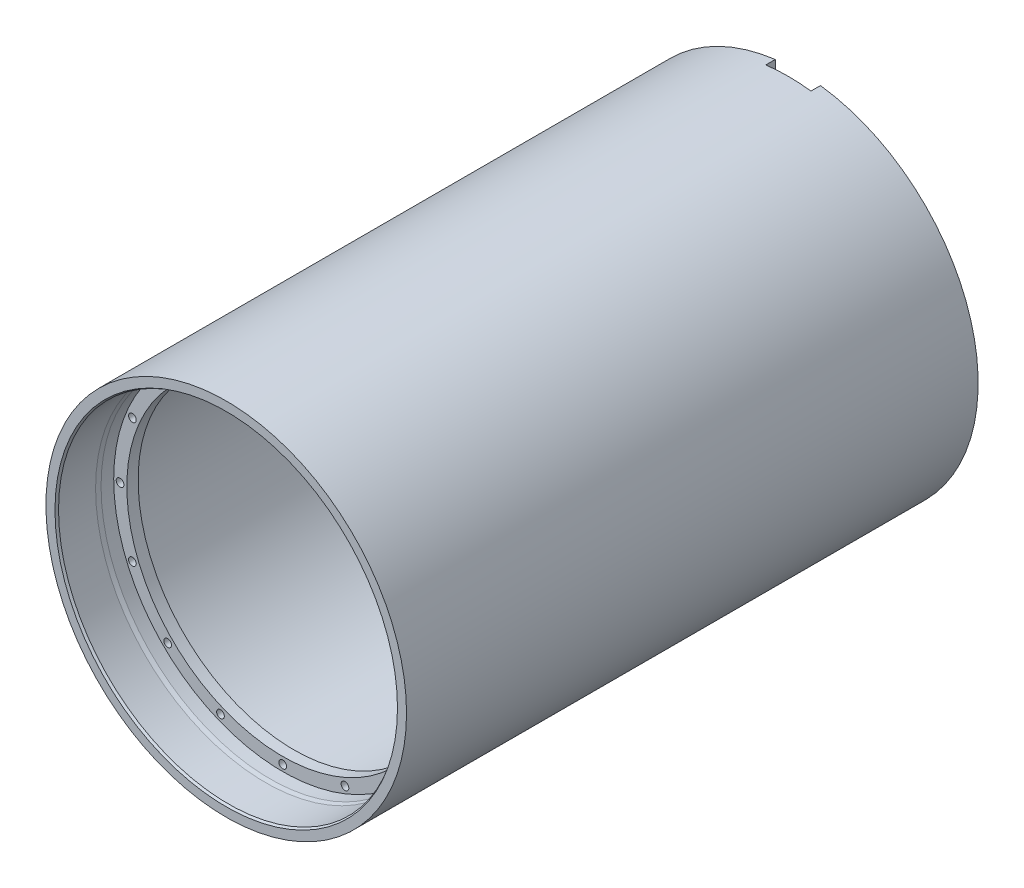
ISO-10303-21;
HEADER;
FILE_DESCRIPTION(('STEP AP214'),'2;1');
FILE_NAME('part.step','',(''),(''),'','','');
FILE_SCHEMA(('AUTOMOTIVE_DESIGN { 1 0 10303 214 1 1 1 1 }'));
ENDSEC;
DATA;
#1=APPLICATION_CONTEXT('core data for automotive mechanical design processes');
#2=APPLICATION_PROTOCOL_DEFINITION('international standard','automotive_design',2000,#1);
#3=PRODUCT_CONTEXT('',#1,'mechanical');
#4=PRODUCT('Part','Part','',(#3));
#5=PRODUCT_RELATED_PRODUCT_CATEGORY('part','',(#4));
#6=PRODUCT_DEFINITION_FORMATION('','',#4);
#7=PRODUCT_DEFINITION_CONTEXT('part definition',#1,'design');
#8=PRODUCT_DEFINITION('design','',#6,#7);
#9=PRODUCT_DEFINITION_SHAPE('','',#8);
#10=(LENGTH_UNIT() NAMED_UNIT(*) SI_UNIT(.MILLI.,.METRE.));
#11=(NAMED_UNIT(*) PLANE_ANGLE_UNIT() SI_UNIT($,.RADIAN.));
#12=(NAMED_UNIT(*) SI_UNIT($,.STERADIAN.) SOLID_ANGLE_UNIT());
#13=UNCERTAINTY_MEASURE_WITH_UNIT(LENGTH_MEASURE(1.E-05),#10,'distance_accuracy_value','');
#14=(GEOMETRIC_REPRESENTATION_CONTEXT(3) GLOBAL_UNCERTAINTY_ASSIGNED_CONTEXT((#13)) GLOBAL_UNIT_ASSIGNED_CONTEXT((#10,
#11,#12)) REPRESENTATION_CONTEXT('',''));
#15=CARTESIAN_POINT('',(0.,0.,0.));
#16=DIRECTION('',(0.,0.,1.));
#17=DIRECTION('',(1.,0.,0.));
#18=AXIS2_PLACEMENT_3D('',#15,#16,#17);
#19=CARTESIAN_POINT('',(0.,0.,0.));
#20=DIRECTION('',(0.,0.,1.));
#21=DIRECTION('',(1.,0.,0.));
#22=AXIS2_PLACEMENT_3D('',#19,#20,#21);
#23=PLANE('',#22);
#24=CARTESIAN_POINT('',(0.,0.,0.));
#25=DIRECTION('',(0.,0.,1.));
#26=DIRECTION('',(1.,0.,0.));
#27=AXIS2_PLACEMENT_3D('',#24,#25,#26);
#28=CIRCLE('',#27,101.346);
#29=CARTESIAN_POINT('',(-12.7,100.54711192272,0.));
#30=VERTEX_POINT('',#29);
#31=CARTESIAN_POINT('',(-12.7,-100.54711192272,0.));
#32=VERTEX_POINT('',#31);
#33=EDGE_CURVE('E157',#30,#32,#28,.T.);
#34=ORIENTED_EDGE('',*,*,#33,.F.);
#35=DIRECTION('',(0.,1.,0.));
#36=VECTOR('',#35,1.);
#37=CARTESIAN_POINT('',(-12.7,-101.346,0.));
#38=LINE('',#37,#36);
#39=CARTESIAN_POINT('',(-12.7,95.193971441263,0.));
#40=VERTEX_POINT('',#39);
#41=EDGE_CURVE('E142',#40,#30,#38,.T.);
#42=ORIENTED_EDGE('',*,*,#41,.F.);
#43=CARTESIAN_POINT('',(0.,0.,0.));
#44=DIRECTION('',(0.,0.,-1.));
#45=DIRECTION('',(-1.,0.,0.));
#46=AXIS2_PLACEMENT_3D('',#43,#44,#45);
#47=CIRCLE('',#46,96.0374);
#48=CARTESIAN_POINT('',(-12.7,-95.193971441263,0.));
#49=VERTEX_POINT('',#48);
#50=EDGE_CURVE('E179',#49,#40,#47,.T.);
#51=ORIENTED_EDGE('',*,*,#50,.F.);
#52=EDGE_CURVE('E232',#32,#49,#38,.T.);
#53=ORIENTED_EDGE('',*,*,#52,.F.);
#54=EDGE_LOOP('',(#34,#42,#51,#53));
#55=FACE_BOUND('',#54,.T.);
#56=ADVANCED_FACE('F42',(#55),#23,.F.);
#57=CARTESIAN_POINT('',(0.,0.,6.35));
#58=DIRECTION('',(0.,0.,-1.));
#59=DIRECTION('',(-1.,0.,0.));
#60=AXIS2_PLACEMENT_3D('',#57,#58,#59);
#61=CYLINDRICAL_SURFACE('',#60,96.0374);
#62=ORIENTED_EDGE('',*,*,#50,.T.);
#63=DIRECTION('',(0.,0.,-1.));
#64=VECTOR('',#63,1.);
#65=CARTESIAN_POINT('',(-12.7,95.193971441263,6.35));
#66=LINE('',#65,#64);
#67=CARTESIAN_POINT('',(-12.7,95.193971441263,2.032));
#68=VERTEX_POINT('',#67);
#69=EDGE_CURVE('E256',#40,#68,#66,.F.);
#70=ORIENTED_EDGE('',*,*,#69,.T.);
#71=CARTESIAN_POINT('',(0.,0.,2.032));
#72=DIRECTION('',(0.,0.,-1.));
#73=DIRECTION('',(-1.,0.,0.));
#74=AXIS2_PLACEMENT_3D('',#71,#72,#73);
#75=CIRCLE('',#74,96.0374);
#76=CARTESIAN_POINT('',(-12.7,-95.193971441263,2.03199999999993));
#77=VERTEX_POINT('',#76);
#78=EDGE_CURVE('E172',#68,#77,#75,.F.);
#79=ORIENTED_EDGE('',*,*,#78,.T.);
#80=DIRECTION('',(0.,0.,-1.));
#81=VECTOR('',#80,1.);
#82=CARTESIAN_POINT('',(-12.7,-95.193971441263,6.35));
#83=LINE('',#82,#81);
#84=EDGE_CURVE('E993',#77,#49,#83,.T.);
#85=ORIENTED_EDGE('',*,*,#84,.T.);
#86=EDGE_LOOP('',(#62,#70,#79,#85));
#87=FACE_BOUND('',#86,.T.);
#88=ADVANCED_FACE('F288',(#87),#61,.F.);
#89=CARTESIAN_POINT('',(0.,0.,3.683));
#90=DIRECTION('',(0.,0.,-1.));
#91=DIRECTION('',(-1.,0.,0.));
#92=AXIS2_PLACEMENT_3D('',#89,#90,#91);
#93=TOROIDAL_SURFACE('',#92,96.0374,1.651);
#94=CARTESIAN_POINT('',(0.,0.,5.334));
#95=DIRECTION('',(0.,0.,-1.));
#96=DIRECTION('',(-1.,0.,0.));
#97=AXIS2_PLACEMENT_3D('',#94,#95,#96);
#98=CIRCLE('',#97,96.0374);
#99=CARTESIAN_POINT('',(-12.7,95.193971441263,5.334));
#100=VERTEX_POINT('',#99);
#101=CARTESIAN_POINT('',(-12.7,-95.193971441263,5.334));
#102=VERTEX_POINT('',#101);
#103=EDGE_CURVE('E181',#100,#102,#98,.F.);
#104=ORIENTED_EDGE('',*,*,#103,.T.);
#105=CARTESIAN_POINT('',(-12.7,-96.695533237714,4.39710093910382));
#106=CARTESIAN_POINT('',(-12.7,-96.7356358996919,4.31420762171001));
#107=CARTESIAN_POINT('',(-12.7,-96.7687891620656,4.22788057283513));
#108=CARTESIAN_POINT('',(-12.7,-96.8201627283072,4.05081751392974));
#109=CARTESIAN_POINT('',(-12.7,-96.838366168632,3.96007664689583));
#110=CARTESIAN_POINT('',(-12.7,-96.8592531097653,3.77684917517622));
#111=CARTESIAN_POINT('',(-12.7,-96.8619420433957,3.68436319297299));
#112=CARTESIAN_POINT('',(-12.7,-96.8517292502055,3.50028028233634));
#113=CARTESIAN_POINT('',(-12.7,-96.8388311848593,3.40868315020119));
#114=CARTESIAN_POINT('',(-12.7,-96.7978618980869,3.22906428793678));
#115=CARTESIAN_POINT('',(-12.7,-96.7698088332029,3.14103841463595));
#116=CARTESIAN_POINT('',(-12.7,-96.6993694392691,2.97092021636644));
#117=CARTESIAN_POINT('',(-12.7,-96.6569824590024,2.88882816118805));
#118=CARTESIAN_POINT('',(-12.7,-96.558950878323,2.73260349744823));
#119=CARTESIAN_POINT('',(-12.7,-96.5032625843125,2.65849831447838));
#120=CARTESIAN_POINT('',(-12.7,-96.3803186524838,2.52060346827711));
#121=CARTESIAN_POINT('',(-12.7,-96.3130626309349,2.45681414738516));
#122=CARTESIAN_POINT('',(-12.7,-96.1683709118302,2.34085479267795));
#123=CARTESIAN_POINT('',(-12.7,-96.0908641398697,2.28877345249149));
#124=CARTESIAN_POINT('',(-12.7,-95.9282642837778,2.19823725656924));
#125=CARTESIAN_POINT('',(-12.7,-95.843170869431,2.15978299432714));
#126=CARTESIAN_POINT('',(-12.7,-95.6670563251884,2.09726517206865));
#127=CARTESIAN_POINT('',(-12.7,-95.5759919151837,2.07332351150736));
#128=CARTESIAN_POINT('',(-12.7,-95.3911441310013,2.04097105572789));
#129=CARTESIAN_POINT('',(-12.7,-95.2973606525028,2.0325608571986));
#130=CARTESIAN_POINT('',(-12.7,-95.1091644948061,2.03149047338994));
#131=CARTESIAN_POINT('',(-12.7,-95.0147512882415,2.03892076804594));
#132=CARTESIAN_POINT('',(-12.7,-94.8285076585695,2.06951477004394));
#133=CARTESIAN_POINT('',(-12.7,-94.736677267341,2.09267867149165));
#134=CARTESIAN_POINT('',(-12.7,-94.5581617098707,2.15413205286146));
#135=CARTESIAN_POINT('',(-12.7,-94.471479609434,2.19243044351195));
#136=CARTESIAN_POINT('',(-12.7,-94.3058195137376,2.28310654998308));
#137=CARTESIAN_POINT('',(-12.7,-94.226841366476,2.33548398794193));
#138=CARTESIAN_POINT('',(-12.7,-94.079270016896,2.45257188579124));
#139=CARTESIAN_POINT('',(-12.7,-94.0106269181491,2.51721944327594));
#140=CARTESIAN_POINT('',(-12.7,-93.8852821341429,2.65720867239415));
#141=CARTESIAN_POINT('',(-12.7,-93.8285799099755,2.73254986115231));
#142=CARTESIAN_POINT('',(-12.7,-93.7292423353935,2.89110548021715));
#143=CARTESIAN_POINT('',(-12.7,-93.6864917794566,2.97424773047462));
#144=CARTESIAN_POINT('',(-12.7,-93.6156875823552,3.14657104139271));
#145=CARTESIAN_POINT('',(-12.7,-93.5876332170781,3.23575180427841));
#146=CARTESIAN_POINT('',(-12.7,-93.5472381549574,3.41684058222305));
#147=CARTESIAN_POINT('',(-12.7,-93.5347715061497,3.50872051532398));
#148=CARTESIAN_POINT('',(-12.7,-93.5255098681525,3.69326572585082));
#149=CARTESIAN_POINT('',(-12.7,-93.5287144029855,3.78593097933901));
#150=CARTESIAN_POINT('',(-12.7,-93.5506526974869,3.96902265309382));
#151=CARTESIAN_POINT('',(-12.7,-93.5693237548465,4.05945659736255));
#152=CARTESIAN_POINT('',(-12.7,-93.6215558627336,4.23591511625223));
#153=CARTESIAN_POINT('',(-12.7,-93.6551169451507,4.3219396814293));
#154=CARTESIAN_POINT('',(-12.7,-93.7362144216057,4.48732799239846));
#155=CARTESIAN_POINT('',(-12.7,-93.7837772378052,4.56667877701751));
#156=CARTESIAN_POINT('',(-12.7,-93.8914632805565,4.71634045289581));
#157=CARTESIAN_POINT('',(-12.7,-93.9515868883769,4.7866510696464));
#158=CARTESIAN_POINT('',(-12.7,-94.0831213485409,4.91676674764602));
#159=CARTESIAN_POINT('',(-12.7,-94.1546073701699,4.97649580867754));
#160=CARTESIAN_POINT('',(-12.7,-94.3065186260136,5.0832296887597));
#161=CARTESIAN_POINT('',(-12.7,-94.386944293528,5.1302338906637));
#162=CARTESIAN_POINT('',(-12.7,-94.5552096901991,5.2106153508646));
#163=CARTESIAN_POINT('',(-12.7,-94.6431083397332,5.24386928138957));
#164=CARTESIAN_POINT('',(-12.7,-94.8232193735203,5.2952606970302));
#165=CARTESIAN_POINT('',(-12.7,-94.9154319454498,5.31339752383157));
#166=CARTESIAN_POINT('',(-12.7,-95.102223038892,5.33414077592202));
#167=CARTESIAN_POINT('',(-12.7,-95.1968133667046,5.33664101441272));
#168=CARTESIAN_POINT('',(-12.7,-95.3850738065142,5.32575804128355));
#169=CARTESIAN_POINT('',(-12.7,-95.4787439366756,5.31237514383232));
#170=CARTESIAN_POINT('',(-12.7,-95.6626712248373,5.27004726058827));
#171=CARTESIAN_POINT('',(-12.7,-95.7529222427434,5.24107557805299));
#172=CARTESIAN_POINT('',(-12.7,-95.9272759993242,5.16832537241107));
#173=CARTESIAN_POINT('',(-12.7,-96.0113772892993,5.12454337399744));
#174=CARTESIAN_POINT('',(-12.7,-96.170690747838,5.0235588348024));
#175=CARTESIAN_POINT('',(-12.7,-96.245931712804,4.96640168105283));
#176=CARTESIAN_POINT('',(-12.7,-96.3855824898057,4.84021490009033));
#177=CARTESIAN_POINT('',(-12.7,-96.4500056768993,4.77120015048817));
#178=CARTESIAN_POINT('',(-12.7,-96.5445785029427,4.6507829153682));
#179=CARTESIAN_POINT('',(-12.7,-96.5785748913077,4.60234917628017));
#180=CARTESIAN_POINT('',(-12.7,-96.6411799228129,4.50211563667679));
#181=CARTESIAN_POINT('',(-12.7,-96.669788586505,4.45031584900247));
#182=CARTESIAN_POINT('',(-12.7,-96.695533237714,4.39710093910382));
#183=B_SPLINE_CURVE_WITH_KNOTS('',3,(#105,#106,#107,#108,#109,#110,#111,#112,#113,#114,#115,
#116,#117,#118,#119,#120,#121,#122,#123,#124,#125,#126,#127,#128,#129,#130,#131,#132,#133,#134,
#135,#136,#137,#138,#139,#140,#141,#142,#143,#144,#145,#146,#147,#148,#149,#150,#151,#152,#153,
#154,#155,#156,#157,#158,#159,#160,#161,#162,#163,#164,#165,#166,#167,#168,#169,#170,#171,#172,
#173,#174,#175,#176,#177,#178,#179,#180,#181,#182),.UNSPECIFIED.,.T.,.F.,(4,2,2,2,2,2,2,2,2,2,2,
2,2,2,2,2,2,2,2,2,2,2,2,2,2,2,2,2,2,2,2,2,2,2,2,2,2,2,4),(0.,0.276038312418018,
0.552387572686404,0.82864005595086,1.10482765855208,1.38068510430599,1.6565550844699,
1.93334404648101,2.2101421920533,2.48897140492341,2.76781276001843,3.04896492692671,
3.33012789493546,3.61290115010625,3.89567789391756,4.17862137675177,4.46155927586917,
4.74308407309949,5.02459616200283,5.30372111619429,5.58283231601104,5.85967335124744,
6.13650597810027,6.41222176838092,6.68793814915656,6.96417819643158,7.24042662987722,
7.51858513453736,7.79675712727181,8.07737261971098,8.35800033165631,8.64053171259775,
8.92305750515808,9.20606868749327,9.48914632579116,9.77127695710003,10.0530561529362,
10.2302647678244,10.4074727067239),.UNSPECIFIED.);
#184=CARTESIAN_POINT('',(-12.7,-96.8593490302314,3.68299999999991));
#185=VERTEX_POINT('',#184);
#186=EDGE_CURVE('E1000',#102,#185,#183,.T.);
#187=ORIENTED_EDGE('',*,*,#186,.T.);
#188=CARTESIAN_POINT('',(0.,0.,3.683));
#189=DIRECTION('',(0.,0.,-1.));
#190=DIRECTION('',(-1.,0.,0.));
#191=AXIS2_PLACEMENT_3D('',#188,#189,#190);
#192=CIRCLE('',#191,97.6884);
#193=CARTESIAN_POINT('',(-12.7,96.8593490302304,3.683));
#194=VERTEX_POINT('',#193);
#195=EDGE_CURVE('E182',#194,#185,#192,.F.);
#196=ORIENTED_EDGE('',*,*,#195,.F.);
#197=CARTESIAN_POINT('',(-12.7,93.785137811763,4.56402794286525));
#198=CARTESIAN_POINT('',(-12.7,93.73563320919,4.48627385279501));
#199=CARTESIAN_POINT('',(-12.7,93.6926286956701,4.4043055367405));
#200=CARTESIAN_POINT('',(-12.7,93.6209436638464,4.23425153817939));
#201=CARTESIAN_POINT('',(-12.7,93.5922790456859,4.14615918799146));
#202=CARTESIAN_POINT('',(-12.7,93.5501812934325,3.96642138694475));
#203=CARTESIAN_POINT('',(-12.7,93.5367442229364,3.8747768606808));
#204=CARTESIAN_POINT('',(-12.7,93.525501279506,3.69055706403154));
#205=CARTESIAN_POINT('',(-12.7,93.5276916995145,3.59798201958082));
#206=CARTESIAN_POINT('',(-12.7,93.5475993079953,3.41477520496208));
#207=CARTESIAN_POINT('',(-12.7,93.5652738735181,3.32413879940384));
#208=CARTESIAN_POINT('',(-12.7,93.6155647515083,3.14710950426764));
#209=CARTESIAN_POINT('',(-12.7,93.6481816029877,3.06071676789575));
#210=CARTESIAN_POINT('',(-12.7,93.7274592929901,2.89445836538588));
#211=CARTESIAN_POINT('',(-12.7,93.7741437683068,2.81460397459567));
#212=CARTESIAN_POINT('',(-12.7,93.8801709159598,2.66379713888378));
#213=CARTESIAN_POINT('',(-12.7,93.9395139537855,2.59284495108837));
#214=CARTESIAN_POINT('',(-12.7,94.0695931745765,2.461330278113));
#215=CARTESIAN_POINT('',(-12.7,94.1404040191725,2.4008416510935));
#216=CARTESIAN_POINT('',(-12.7,94.2911004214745,2.29248717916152));
#217=CARTESIAN_POINT('',(-12.7,94.3709863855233,2.24462189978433));
#218=CARTESIAN_POINT('',(-12.7,94.5383183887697,2.16243199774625));
#219=CARTESIAN_POINT('',(-12.7,94.6258246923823,2.1282300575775));
#220=CARTESIAN_POINT('',(-12.7,94.8053140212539,2.07488857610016));
#221=CARTESIAN_POINT('',(-12.7,94.8972972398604,2.05574968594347));
#222=CARTESIAN_POINT('',(-12.7,95.0838080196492,2.03296666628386));
#223=CARTESIAN_POINT('',(-12.7,95.1783487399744,2.02943014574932));
#224=CARTESIAN_POINT('',(-12.7,95.3666882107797,2.03824351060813));
#225=CARTESIAN_POINT('',(-12.7,95.4604869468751,2.05059370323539));
#226=CARTESIAN_POINT('',(-12.7,95.6448717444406,2.09089301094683));
#227=CARTESIAN_POINT('',(-12.7,95.7354509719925,2.11887341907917));
#228=CARTESIAN_POINT('',(-12.7,95.9106009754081,2.18969843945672));
#229=CARTESIAN_POINT('',(-12.7,95.9951718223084,2.23254287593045));
#230=CARTESIAN_POINT('',(-12.7,96.1555577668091,2.33173657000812));
#231=CARTESIAN_POINT('',(-12.7,96.2314037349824,2.38803589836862));
#232=CARTESIAN_POINT('',(-12.7,96.3724754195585,2.51265895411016));
#233=CARTESIAN_POINT('',(-12.7,96.4377015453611,2.58098221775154));
#234=CARTESIAN_POINT('',(-12.7,96.55514433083,2.72716154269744));
#235=CARTESIAN_POINT('',(-12.7,96.6074563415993,2.8049409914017));
#236=CARTESIAN_POINT('',(-12.7,96.6981529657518,2.96823601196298));
#237=CARTESIAN_POINT('',(-12.7,96.7365382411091,3.05375121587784));
#238=CARTESIAN_POINT('',(-12.7,96.797970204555,3.22933415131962));
#239=CARTESIAN_POINT('',(-12.7,96.8211403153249,3.31935871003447));
#240=CARTESIAN_POINT('',(-12.7,96.8519479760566,3.5020267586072));
#241=CARTESIAN_POINT('',(-12.7,96.8595860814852,3.59467015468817));
#242=CARTESIAN_POINT('',(-12.7,96.8591020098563,3.77942377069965));
#243=CARTESIAN_POINT('',(-12.7,96.8510629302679,3.87153422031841));
#244=CARTESIAN_POINT('',(-12.7,96.8196303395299,4.05309534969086));
#245=CARTESIAN_POINT('',(-12.7,96.7962369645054,4.14254605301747));
#246=CARTESIAN_POINT('',(-12.7,96.734795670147,4.31624486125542));
#247=CARTESIAN_POINT('',(-12.7,96.6967502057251,4.40049383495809));
#248=CARTESIAN_POINT('',(-12.7,96.6071225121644,4.56145178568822));
#249=CARTESIAN_POINT('',(-12.7,96.5555400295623,4.63816062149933));
#250=CARTESIAN_POINT('',(-12.7,96.440045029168,4.78228300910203));
#251=CARTESIAN_POINT('',(-12.7,96.3760724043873,4.84964838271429));
#252=CARTESIAN_POINT('',(-12.7,96.2378056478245,4.97278789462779));
#253=CARTESIAN_POINT('',(-12.7,96.1635110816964,5.02856154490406));
#254=CARTESIAN_POINT('',(-12.7,96.006071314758,5.12741494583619));
#255=CARTESIAN_POINT('',(-12.7,95.9228596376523,5.17038881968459));
#256=CARTESIAN_POINT('',(-12.7,95.7504423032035,5.24188063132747));
#257=CARTESIAN_POINT('',(-12.7,95.6612363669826,5.27039789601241));
#258=CARTESIAN_POINT('',(-12.7,95.4786159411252,5.31238393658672));
#259=CARTESIAN_POINT('',(-12.7,95.3851740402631,5.32573353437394));
#260=CARTESIAN_POINT('',(-12.7,95.1973758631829,5.3366271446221));
#261=CARTESIAN_POINT('',(-12.7,95.1030195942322,5.33417128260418));
#262=CARTESIAN_POINT('',(-12.7,94.9156633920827,5.31348078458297));
#263=CARTESIAN_POINT('',(-12.7,94.822670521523,5.29518212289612));
#264=CARTESIAN_POINT('',(-12.7,94.641057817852,5.24320504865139));
#265=CARTESIAN_POINT('',(-12.7,94.5524390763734,5.20952281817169));
#266=CARTESIAN_POINT('',(-12.7,94.3822326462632,5.12774281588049));
#267=CARTESIAN_POINT('',(-12.7,94.3006384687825,5.07965853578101));
#268=CARTESIAN_POINT('',(-12.7,94.1468274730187,4.97041811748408));
#269=CARTESIAN_POINT('',(-12.7,94.0745992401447,4.90927813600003));
#270=CARTESIAN_POINT('',(-12.7,93.9660763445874,4.80027676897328));
#271=CARTESIAN_POINT('',(-12.7,93.9263313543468,4.75579354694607));
#272=CARTESIAN_POINT('',(-12.7,93.8518645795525,4.6628033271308));
#273=CARTESIAN_POINT('',(-12.7,93.8171427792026,4.61429634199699));
#274=CARTESIAN_POINT('',(-12.7,93.785137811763,4.56402794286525));
#275=B_SPLINE_CURVE_WITH_KNOTS('',3,(#197,#198,#199,#200,#201,#202,#203,#204,#205,#206,#207,
#208,#209,#210,#211,#212,#213,#214,#215,#216,#217,#218,#219,#220,#221,#222,#223,#224,#225,#226,
#227,#228,#229,#230,#231,#232,#233,#234,#235,#236,#237,#238,#239,#240,#241,#242,#243,#244,#245,
#246,#247,#248,#249,#250,#251,#252,#253,#254,#255,#256,#257,#258,#259,#260,#261,#262,#263,#264,
#265,#266,#267,#268,#269,#270,#271,#272,#273,#274),.UNSPECIFIED.,.T.,.F.,(4,2,2,2,2,2,2,2,2,2,2,
2,2,2,2,2,2,2,2,2,2,2,2,2,2,2,2,2,2,2,2,2,2,2,2,2,2,2,4),(0.,0.276311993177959,
0.552929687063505,0.829475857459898,1.10595642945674,1.38167832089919,1.65741015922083,
1.93360789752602,2.20981361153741,2.48789575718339,2.76599035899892,3.04652867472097,
3.32707911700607,3.60956151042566,3.89204936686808,4.17510482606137,4.45815693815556,
4.74017456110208,5.02218130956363,5.30203901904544,5.58188342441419,5.85942878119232,
6.13696421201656,6.41303255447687,6.68909844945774,6.96511811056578,7.24114294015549,
7.51854196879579,7.79595267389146,8.07559809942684,8.35525654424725,8.63709749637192,
8.91893621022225,9.20191926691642,9.48497259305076,9.76776158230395,10.050202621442,
10.2288402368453,10.4074772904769),.UNSPECIFIED.);
#276=EDGE_CURVE('E152',#194,#100,#275,.T.);
#277=ORIENTED_EDGE('',*,*,#276,.T.);
#278=EDGE_LOOP('',(#104,#187,#196,#277));
#279=FACE_BOUND('',#278,.T.);
#280=ADVANCED_FACE('F241',(#279),#93,.F.);
#281=CARTESIAN_POINT('',(0.,0.,3.683));
#282=DIRECTION('',(0.,0.,-1.));
#283=DIRECTION('',(-1.,0.,0.));
#284=AXIS2_PLACEMENT_3D('',#281,#282,#283);
#285=TOROIDAL_SURFACE('',#284,96.0374,1.651);
#286=ORIENTED_EDGE('',*,*,#195,.T.);
#287=CARTESIAN_POINT('',(-12.7,-96.5467592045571,2.72002117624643));
#288=CARTESIAN_POINT('',(-12.7,-96.4919996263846,2.64442015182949));
#289=CARTESIAN_POINT('',(-12.7,-96.4307718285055,2.57341577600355));
#290=CARTESIAN_POINT('',(-12.7,-96.2971882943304,2.44266156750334));
#291=CARTESIAN_POINT('',(-12.7,-96.2248181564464,2.38292652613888));
#292=CARTESIAN_POINT('',(-12.7,-96.0711489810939,2.27647214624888));
#293=CARTESIAN_POINT('',(-12.7,-95.9898574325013,2.22974200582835));
#294=CARTESIAN_POINT('',(-12.7,-95.8206428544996,2.15051430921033));
#295=CARTESIAN_POINT('',(-12.7,-95.7327214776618,2.11801321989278));
#296=CARTESIAN_POINT('',(-12.7,-95.5521588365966,2.06793783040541));
#297=CARTESIAN_POINT('',(-12.7,-95.4594925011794,2.05045391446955));
#298=CARTESIAN_POINT('',(-12.7,-95.2725364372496,2.03120816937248));
#299=CARTESIAN_POINT('',(-12.7,-95.1782465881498,2.02944751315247));
#300=CARTESIAN_POINT('',(-12.7,-94.9902450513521,2.04172495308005));
#301=CARTESIAN_POINT('',(-12.7,-94.896538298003,2.05583878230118));
#302=CARTESIAN_POINT('',(-12.7,-94.7128252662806,2.09960649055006));
#303=CARTESIAN_POINT('',(-12.7,-94.6228190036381,2.12926043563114));
#304=CARTESIAN_POINT('',(-12.7,-94.4491384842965,2.20327972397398));
#305=CARTESIAN_POINT('',(-12.7,-94.3654602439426,2.24763571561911));
#306=CARTESIAN_POINT('',(-12.7,-94.2067977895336,2.34984682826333));
#307=CARTESIAN_POINT('',(-12.7,-94.1318133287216,2.40770156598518));
#308=CARTESIAN_POINT('',(-12.7,-93.9931619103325,2.53491370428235));
#309=CARTESIAN_POINT('',(-12.7,-93.929429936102,2.60420022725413));
#310=CARTESIAN_POINT('',(-12.7,-93.8146266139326,2.7525711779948));
#311=CARTESIAN_POINT('',(-12.7,-93.7635546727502,2.83165514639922));
#312=CARTESIAN_POINT('',(-12.7,-93.6759959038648,2.99663394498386));
#313=CARTESIAN_POINT('',(-12.7,-93.6393853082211,3.08246309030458));
#314=CARTESIAN_POINT('',(-12.7,-93.5812180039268,3.25907906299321));
#315=CARTESIAN_POINT('',(-12.7,-93.5596605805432,3.34986565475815));
#316=CARTESIAN_POINT('',(-12.7,-93.5323572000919,3.5330842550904));
#317=CARTESIAN_POINT('',(-12.7,-93.5264932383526,3.62549869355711));
#318=CARTESIAN_POINT('',(-12.7,-93.5304128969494,3.80999379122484));
#319=CARTESIAN_POINT('',(-12.7,-93.5401961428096,3.90207445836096));
#320=CARTESIAN_POINT('',(-12.7,-93.5750649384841,4.08301658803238));
#321=CARTESIAN_POINT('',(-12.7,-93.6001068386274,4.17188647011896));
#322=CARTESIAN_POINT('',(-12.7,-93.6647100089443,4.34418000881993));
#323=CARTESIAN_POINT('',(-12.7,-93.7042714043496,4.42760361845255));
#324=CARTESIAN_POINT('',(-12.7,-93.7968961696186,4.5869312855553));
#325=CARTESIAN_POINT('',(-12.7,-93.8500013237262,4.66281104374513));
#326=CARTESIAN_POINT('',(-12.7,-93.9681075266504,4.8046639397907));
#327=CARTESIAN_POINT('',(-12.7,-94.0331090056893,4.87063671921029));
#328=CARTESIAN_POINT('',(-12.7,-94.1736852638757,4.99134750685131));
#329=CARTESIAN_POINT('',(-12.7,-94.249336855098,5.04599605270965));
#330=CARTESIAN_POINT('',(-12.7,-94.4086767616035,5.1419454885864));
#331=CARTESIAN_POINT('',(-12.7,-94.4923654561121,5.18324574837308));
#332=CARTESIAN_POINT('',(-12.7,-94.6661838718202,5.25169471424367));
#333=CARTESIAN_POINT('',(-12.7,-94.7563631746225,5.2787175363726));
#334=CARTESIAN_POINT('',(-12.7,-94.9399668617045,5.31733979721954));
#335=CARTESIAN_POINT('',(-12.7,-95.0333913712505,5.32893863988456));
#336=CARTESIAN_POINT('',(-12.7,-95.2214226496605,5.33642359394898));
#337=CARTESIAN_POINT('',(-12.7,-95.3160331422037,5.33221650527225));
#338=CARTESIAN_POINT('',(-12.7,-95.50320916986,5.30799035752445));
#339=CARTESIAN_POINT('',(-12.7,-95.5957746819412,5.28797112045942));
#340=CARTESIAN_POINT('',(-12.7,-95.7762807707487,5.23264091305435));
#341=CARTESIAN_POINT('',(-12.7,-95.8642185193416,5.19732071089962));
#342=CARTESIAN_POINT('',(-12.7,-96.0328756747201,5.11234823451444));
#343=CARTESIAN_POINT('',(-12.7,-96.113595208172,5.06269621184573));
#344=CARTESIAN_POINT('',(-12.7,-96.2650893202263,4.95070833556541));
#345=CARTESIAN_POINT('',(-12.7,-96.3359103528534,4.88843533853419));
#346=CARTESIAN_POINT('',(-12.7,-96.4659868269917,4.75279591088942));
#347=CARTESIAN_POINT('',(-12.7,-96.525242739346,4.67942993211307));
#348=CARTESIAN_POINT('',(-12.7,-96.6299925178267,4.52432118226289));
#349=CARTESIAN_POINT('',(-12.7,-96.6755938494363,4.44265098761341));
#350=CARTESIAN_POINT('',(-12.7,-96.7523114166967,4.27277276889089));
#351=CARTESIAN_POINT('',(-12.7,-96.783428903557,4.18456531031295));
#352=CARTESIAN_POINT('',(-12.7,-96.8300575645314,4.00486393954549));
#353=CARTESIAN_POINT('',(-12.7,-96.8456901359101,3.91340151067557));
#354=CARTESIAN_POINT('',(-12.7,-96.861309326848,3.72912569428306));
#355=CARTESIAN_POINT('',(-12.7,-96.8612924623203,3.63631201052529));
#356=CARTESIAN_POINT('',(-12.7,-96.8456396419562,3.45236708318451));
#357=CARTESIAN_POINT('',(-12.7,-96.830061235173,3.36123090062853));
#358=CARTESIAN_POINT('',(-12.7,-96.7838415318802,3.18294472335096));
#359=CARTESIAN_POINT('',(-12.7,-96.7532186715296,3.0957899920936));
#360=CARTESIAN_POINT('',(-12.7,-96.6925134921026,2.96049398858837));
#361=CARTESIAN_POINT('',(-12.7,-96.6668281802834,2.910331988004));
#362=CARTESIAN_POINT('',(-12.7,-96.6104660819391,2.81289625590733));
#363=CARTESIAN_POINT('',(-12.7,-96.5797893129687,2.76562251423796));
#364=CARTESIAN_POINT('',(-12.7,-96.5467592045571,2.72002117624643));
#365=B_SPLINE_CURVE_WITH_KNOTS('',3,(#287,#288,#289,#290,#291,#292,#293,#294,#295,#296,#297,
#298,#299,#300,#301,#302,#303,#304,#305,#306,#307,#308,#309,#310,#311,#312,#313,#314,#315,#316,
#317,#318,#319,#320,#321,#322,#323,#324,#325,#326,#327,#328,#329,#330,#331,#332,#333,#334,#335,
#336,#337,#338,#339,#340,#341,#342,#343,#344,#345,#346,#347,#348,#349,#350,#351,#352,#353,#354,
#355,#356,#357,#358,#359,#360,#361,#362,#363,#364),.UNSPECIFIED.,.T.,.F.,(4,2,2,2,2,2,2,2,2,2,2,
2,2,2,2,2,2,2,2,2,2,2,2,2,2,2,2,2,2,2,2,2,2,2,2,2,2,2,4),(0.,0.279840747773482,
0.560046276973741,0.840018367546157,1.11992090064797,1.40149651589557,1.68309313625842,
1.96603890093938,2.24898586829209,2.53175320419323,2.81451251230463,3.09558039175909,
3.3766350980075,3.65522937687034,3.93381042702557,4.21029076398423,4.48676448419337,
4.76245099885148,5.03813989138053,5.31468983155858,5.5912497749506,5.86991761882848,
6.14859861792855,6.42969738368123,6.71080701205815,6.99357680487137,7.27634978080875,
7.55929360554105,7.84223246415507,8.1237953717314,8.40534681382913,8.68462031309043,
8.96386968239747,9.24091206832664,9.51801613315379,9.79409920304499,10.0698447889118,
10.2386408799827,10.4074363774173),.UNSPECIFIED.);
#366=EDGE_CURVE('E272',#185,#77,#365,.T.);
#367=ORIENTED_EDGE('',*,*,#366,.T.);
#368=ORIENTED_EDGE('',*,*,#78,.F.);
#369=CARTESIAN_POINT('',(-12.7,93.9825344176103,2.54976987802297));
#370=CARTESIAN_POINT('',(-12.7,94.0471559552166,2.48192599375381));
#371=CARTESIAN_POINT('',(-12.7,94.1175934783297,2.41952224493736));
#372=CARTESIAN_POINT('',(-12.7,94.2680233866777,2.30739852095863));
#373=CARTESIAN_POINT('',(-12.7,94.3480282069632,2.25769532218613));
#374=CARTESIAN_POINT('',(-12.7,94.5151745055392,2.17243185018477));
#375=CARTESIAN_POINT('',(-12.7,94.6023101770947,2.13686020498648));
#376=CARTESIAN_POINT('',(-12.7,94.7812705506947,2.08077626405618));
#377=CARTESIAN_POINT('',(-12.7,94.8730940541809,2.06026013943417));
#378=CARTESIAN_POINT('',(-12.7,95.0593625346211,2.03475024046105));
#379=CARTESIAN_POINT('',(-12.7,95.1538186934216,2.02983804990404));
#380=CARTESIAN_POINT('',(-12.7,95.3422253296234,2.03590099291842));
#381=CARTESIAN_POINT('',(-12.7,95.4361757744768,2.04687713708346));
#382=CARTESIAN_POINT('',(-12.7,95.6211158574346,2.08446922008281));
#383=CARTESIAN_POINT('',(-12.7,95.7120983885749,2.11112015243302));
#384=CARTESIAN_POINT('',(-12.7,95.8882747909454,2.17936960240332));
#385=CARTESIAN_POINT('',(-12.7,95.9734687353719,2.22096793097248));
#386=CARTESIAN_POINT('',(-12.7,96.135321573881,2.3178040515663));
#387=CARTESIAN_POINT('',(-12.7,96.2120087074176,2.3729946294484));
#388=CARTESIAN_POINT('',(-12.7,96.3549394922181,2.49555706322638));
#389=CARTESIAN_POINT('',(-12.7,96.4211835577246,2.5629284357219));
#390=CARTESIAN_POINT('',(-12.7,96.5408089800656,2.7074043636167));
#391=CARTESIAN_POINT('',(-12.7,96.5942832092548,2.78443201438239));
#392=CARTESIAN_POINT('',(-12.7,96.6874141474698,2.94643159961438));
#393=CARTESIAN_POINT('',(-12.7,96.7270714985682,3.03140316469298));
#394=CARTESIAN_POINT('',(-12.7,96.7911069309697,3.20612240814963));
#395=CARTESIAN_POINT('',(-12.7,96.8156086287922,3.2958247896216));
#396=CARTESIAN_POINT('',(-12.7,96.849111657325,3.47807825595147));
#397=CARTESIAN_POINT('',(-12.7,96.8581135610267,3.57062923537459));
#398=CARTESIAN_POINT('',(-12.7,96.8603406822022,3.75541207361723));
#399=CARTESIAN_POINT('',(-12.7,96.8536519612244,3.84764290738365));
#400=CARTESIAN_POINT('',(-12.7,96.8248768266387,4.02966892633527));
#401=CARTESIAN_POINT('',(-12.7,96.8027905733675,4.11946413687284));
#402=CARTESIAN_POINT('',(-12.7,96.7438889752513,4.29404291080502));
#403=CARTESIAN_POINT('',(-12.7,96.7070796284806,4.3788284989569));
#404=CARTESIAN_POINT('',(-12.7,96.6198144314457,4.54105693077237));
#405=CARTESIAN_POINT('',(-12.7,96.5693583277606,4.61849963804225));
#406=CARTESIAN_POINT('',(-12.7,96.455991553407,4.76425426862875));
#407=CARTESIAN_POINT('',(-12.7,96.3930224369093,4.83252072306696));
#408=CARTESIAN_POINT('',(-12.7,96.2565980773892,4.95761578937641));
#409=CARTESIAN_POINT('',(-12.7,96.1831424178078,5.01444394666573));
#410=CARTESIAN_POINT('',(-12.7,96.0272049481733,5.11553577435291));
#411=CARTESIAN_POINT('',(-12.7,95.9446557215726,5.15969544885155));
#412=CARTESIAN_POINT('',(-12.7,95.7733572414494,5.23365380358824));
#413=CARTESIAN_POINT('',(-12.7,95.684607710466,5.26345184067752));
#414=CARTESIAN_POINT('',(-12.7,95.5026781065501,5.30807199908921));
#415=CARTESIAN_POINT('',(-12.7,95.409468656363,5.3227743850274));
#416=CARTESIAN_POINT('',(-12.7,95.2219024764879,5.33639758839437));
#417=CARTESIAN_POINT('',(-12.7,95.1275457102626,5.33531790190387));
#418=CARTESIAN_POINT('',(-12.7,94.9399269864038,5.3173676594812));
#419=CARTESIAN_POINT('',(-12.7,94.8466716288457,5.30042800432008));
#420=CARTESIAN_POINT('',(-12.7,94.66433257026,5.25111620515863));
#421=CARTESIAN_POINT('',(-12.7,94.5752488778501,5.21874402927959));
#422=CARTESIAN_POINT('',(-12.7,94.4039085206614,5.13949402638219));
#423=CARTESIAN_POINT('',(-12.7,94.3216440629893,5.09263305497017));
#424=CARTESIAN_POINT('',(-12.7,94.1662160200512,4.98568140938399));
#425=CARTESIAN_POINT('',(-12.7,94.0930521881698,4.92559109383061));
#426=CARTESIAN_POINT('',(-12.7,93.9584152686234,4.7942819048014));
#427=CARTESIAN_POINT('',(-12.7,93.8968706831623,4.72313635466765));
#428=CARTESIAN_POINT('',(-12.7,93.7867265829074,4.57144423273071));
#429=CARTESIAN_POINT('',(-12.7,93.7381264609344,4.49089810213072));
#430=CARTESIAN_POINT('',(-12.7,93.6557025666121,4.32345170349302));
#431=CARTESIAN_POINT('',(-12.7,93.6217525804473,4.23661355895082));
#432=CARTESIAN_POINT('',(-12.7,93.569035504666,4.05844887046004));
#433=CARTESIAN_POINT('',(-12.7,93.5502671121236,3.96712271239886));
#434=CARTESIAN_POINT('',(-12.7,93.5285596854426,3.78329093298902));
#435=CARTESIAN_POINT('',(-12.7,93.5255054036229,3.69079890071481));
#436=CARTESIAN_POINT('',(-12.7,93.5350096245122,3.50659626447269));
#437=CARTESIAN_POINT('',(-12.7,93.5475717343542,3.4148858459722));
#438=CARTESIAN_POINT('',(-12.7,93.5878922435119,3.23505832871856));
#439=CARTESIAN_POINT('',(-12.7,93.6156226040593,3.14693492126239));
#440=CARTESIAN_POINT('',(-12.7,93.6854215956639,2.97665014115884));
#441=CARTESIAN_POINT('',(-12.7,93.7274729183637,2.89448171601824));
#442=CARTESIAN_POINT('',(-12.7,93.8057868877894,2.76861561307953));
#443=CARTESIAN_POINT('',(-12.7,93.8379878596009,2.72233970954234));
#444=CARTESIAN_POINT('',(-12.7,93.9069366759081,2.63331042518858));
#445=CARTESIAN_POINT('',(-12.7,93.943684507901,2.59055703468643));
#446=CARTESIAN_POINT('',(-12.7,93.9825344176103,2.54976987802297));
#447=B_SPLINE_CURVE_WITH_KNOTS('',3,(#369,#370,#371,#372,#373,#374,#375,#376,#377,#378,#379,
#380,#381,#382,#383,#384,#385,#386,#387,#388,#389,#390,#391,#392,#393,#394,#395,#396,#397,#398,
#399,#400,#401,#402,#403,#404,#405,#406,#407,#408,#409,#410,#411,#412,#413,#414,#415,#416,#417,
#418,#419,#420,#421,#422,#423,#424,#425,#426,#427,#428,#429,#430,#431,#432,#433,#434,#435,#436,
#437,#438,#439,#440,#441,#442,#443,#444,#445,#446),.UNSPECIFIED.,.T.,.F.,(4,2,2,2,2,2,2,2,2,2,2,
2,2,2,2,2,2,2,2,2,2,2,2,2,2,2,2,2,2,2,2,2,2,2,2,2,2,2,4),(0.,0.280877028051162,
0.562123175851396,0.843142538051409,1.12409040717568,1.40650479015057,1.68893713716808,
1.97200241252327,2.2550641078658,2.5371560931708,2.81923688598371,3.09919902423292,
3.37914815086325,3.65678268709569,3.93440695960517,4.21051205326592,4.48661427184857,
4.76260412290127,5.03859909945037,5.31591484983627,5.59324161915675,5.87278377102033,
6.15233844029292,6.43409373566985,6.71585802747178,6.99885566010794,7.28185387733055,
7.56452409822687,7.84718665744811,8.12804874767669,8.40889766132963,8.68727620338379,
8.96563085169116,9.2419411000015,9.51831518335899,9.79418010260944,10.0697127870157,
10.2385740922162,10.4074349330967),.UNSPECIFIED.);
#448=EDGE_CURVE('E267',#68,#194,#447,.T.);
#449=ORIENTED_EDGE('',*,*,#448,.T.);
#450=EDGE_LOOP('',(#286,#367,#368,#449));
#451=FACE_BOUND('',#450,.T.);
#452=ADVANCED_FACE('F320',(#451),#285,.F.);
#453=CARTESIAN_POINT('',(0.,0.,321.31));
#454=DIRECTION('',(0.,0.,-1.));
#455=DIRECTION('',(-1.,0.,0.));
#456=AXIS2_PLACEMENT_3D('',#453,#454,#455);
#457=CYLINDRICAL_SURFACE('',#456,94.996);
#458=CARTESIAN_POINT('',(0.,0.,296.671999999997));
#459=DIRECTION('',(0.,0.,1.));
#460=DIRECTION('',(1.,0.,0.));
#461=AXIS2_PLACEMENT_3D('',#458,#459,#460);
#462=CIRCLE('',#461,94.996);
#463=CARTESIAN_POINT('',(-94.996,0.,296.671999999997));
#464=VERTEX_POINT('',#463);
#465=EDGE_CURVE('E194',#464,#464,#462,.T.);
#466=CARTESIAN_POINT('',(0.,0.,289.56));
#467=DIRECTION('',(0.,0.,1.));
#468=DIRECTION('',(1.,0.,0.));
#469=AXIS2_PLACEMENT_3D('',#466,#467,#468);
#470=CIRCLE('',#469,94.996);
#471=CARTESIAN_POINT('',(-94.996,0.,289.56));
#472=VERTEX_POINT('',#471);
#473=EDGE_CURVE('E191',#472,#472,#470,.T.);
#474=CARTESIAN_POINT('',(-94.996,0.,296.671999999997));
#475=CARTESIAN_POINT('',(-94.996,0.,296.597916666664));
#476=CARTESIAN_POINT('',(-94.996,0.,296.52383333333));
#477=CARTESIAN_POINT('',(-94.996,0.,296.375666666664));
#478=CARTESIAN_POINT('',(-94.996,0.,296.30158333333));
#479=CARTESIAN_POINT('',(-94.996,0.,296.153416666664));
#480=CARTESIAN_POINT('',(-94.996,0.,296.079333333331));
#481=CARTESIAN_POINT('',(-94.996,0.,295.931166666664));
#482=CARTESIAN_POINT('',(-94.996,0.,295.857083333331));
#483=CARTESIAN_POINT('',(-94.996,0.,295.708916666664));
#484=CARTESIAN_POINT('',(-94.996,0.,295.634833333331));
#485=CARTESIAN_POINT('',(-94.996,0.,295.486666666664));
#486=CARTESIAN_POINT('',(-94.996,0.,295.412583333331));
#487=CARTESIAN_POINT('',(-94.996,0.,295.264416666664));
#488=CARTESIAN_POINT('',(-94.996,0.,295.190333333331));
#489=CARTESIAN_POINT('',(-94.996,0.,295.042166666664));
#490=CARTESIAN_POINT('',(-94.996,0.,294.968083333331));
#491=CARTESIAN_POINT('',(-94.996,0.,294.819916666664));
#492=CARTESIAN_POINT('',(-94.996,0.,294.745833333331));
#493=CARTESIAN_POINT('',(-94.996,0.,294.597666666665));
#494=CARTESIAN_POINT('',(-94.996,0.,294.523583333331));
#495=CARTESIAN_POINT('',(-94.996,0.,294.375416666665));
#496=CARTESIAN_POINT('',(-94.996,0.,294.301333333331));
#497=CARTESIAN_POINT('',(-94.996,0.,294.153166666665));
#498=CARTESIAN_POINT('',(-94.996,0.,294.079083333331));
#499=CARTESIAN_POINT('',(-94.996,0.,293.930916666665));
#500=CARTESIAN_POINT('',(-94.996,0.,293.856833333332));
#501=CARTESIAN_POINT('',(-94.996,0.,293.708666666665));
#502=CARTESIAN_POINT('',(-94.996,0.,293.634583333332));
#503=CARTESIAN_POINT('',(-94.996,0.,293.486416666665));
#504=CARTESIAN_POINT('',(-94.996,0.,293.412333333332));
#505=CARTESIAN_POINT('',(-94.996,0.,293.264166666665));
#506=CARTESIAN_POINT('',(-94.996,0.,293.190083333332));
#507=CARTESIAN_POINT('',(-94.996,0.,293.041916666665));
#508=CARTESIAN_POINT('',(-94.996,0.,292.967833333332));
#509=CARTESIAN_POINT('',(-94.996,0.,292.819666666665));
#510=CARTESIAN_POINT('',(-94.996,0.,292.745583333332));
#511=CARTESIAN_POINT('',(-94.996,0.,292.597416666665));
#512=CARTESIAN_POINT('',(-94.996,0.,292.523333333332));
#513=CARTESIAN_POINT('',(-94.996,0.,292.375166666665));
#514=CARTESIAN_POINT('',(-94.996,0.,292.301083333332));
#515=CARTESIAN_POINT('',(-94.996,0.,292.152916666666));
#516=CARTESIAN_POINT('',(-94.996,0.,292.078833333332));
#517=CARTESIAN_POINT('',(-94.996,0.,291.930666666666));
#518=CARTESIAN_POINT('',(-94.996,0.,291.856583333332));
#519=CARTESIAN_POINT('',(-94.996,0.,291.708416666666));
#520=CARTESIAN_POINT('',(-94.996,0.,291.634333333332));
#521=CARTESIAN_POINT('',(-94.996,0.,291.486166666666));
#522=CARTESIAN_POINT('',(-94.996,0.,291.412083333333));
#523=CARTESIAN_POINT('',(-94.996,0.,291.263916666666));
#524=CARTESIAN_POINT('',(-94.996,0.,291.189833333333));
#525=CARTESIAN_POINT('',(-94.996,0.,291.041666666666));
#526=CARTESIAN_POINT('',(-94.996,0.,290.967583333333));
#527=CARTESIAN_POINT('',(-94.996,0.,290.819416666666));
#528=CARTESIAN_POINT('',(-94.996,0.,290.745333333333));
#529=CARTESIAN_POINT('',(-94.996,0.,290.597166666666));
#530=CARTESIAN_POINT('',(-94.996,0.,290.523083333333));
#531=CARTESIAN_POINT('',(-94.996,0.,290.374916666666));
#532=CARTESIAN_POINT('',(-94.996,0.,290.300833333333));
#533=CARTESIAN_POINT('',(-94.996,0.,290.152666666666));
#534=CARTESIAN_POINT('',(-94.996,0.,290.078583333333));
#535=CARTESIAN_POINT('',(-94.996,0.,289.930416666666));
#536=CARTESIAN_POINT('',(-94.996,0.,289.856333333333));
#537=CARTESIAN_POINT('',(-94.996,0.,289.708166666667));
#538=CARTESIAN_POINT('',(-94.996,0.,289.634083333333));
#539=CARTESIAN_POINT('',(-94.996,0.,289.56));
#540=B_SPLINE_CURVE_WITH_KNOTS('',3,(#474,#475,#476,#477,#478,#479,#480,#481,#482,#483,#484,
#485,#486,#487,#488,#489,#490,#491,#492,#493,#494,#495,#496,#497,#498,#499,#500,#501,#502,#503,
#504,#505,#506,#507,#508,#509,#510,#511,#512,#513,#514,#515,#516,#517,#518,#519,#520,#521,#522,
#523,#524,#525,#526,#527,#528,#529,#530,#531,#532,#533,#534,#535,#536,#537,#538,#539),
.UNSPECIFIED.,.F.,.F.,(4,2,2,2,2,2,2,2,2,2,2,2,2,2,2,2,2,2,2,2,2,2,2,2,2,2,2,2,2,2,2,2,4),(0.,
0.222249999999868,0.444499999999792,0.666749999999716,0.888999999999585,1.11124999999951,
1.33349999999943,1.55574999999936,1.77799999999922,2.00024999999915,2.22249999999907,
2.44474999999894,2.66699999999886,2.88924999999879,3.11149999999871,3.33374999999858,
3.5559999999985,3.77824999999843,4.0004999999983,4.22274999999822,4.44499999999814,
4.66724999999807,4.88949999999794,5.11174999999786,5.33399999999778,5.55624999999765,
5.77849999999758,6.0007499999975,6.22299999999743,6.44524999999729,6.66749999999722,
6.88974999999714,7.11199999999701),.UNSPECIFIED.);
#541=EDGE_CURVE('BSEAM315',#464,#472,#540,.T.);
#542=ORIENTED_EDGE('',*,*,#465,.T.);
#543=ORIENTED_EDGE('',*,*,#473,.F.);
#544=ORIENTED_EDGE('',*,*,#541,.T.);
#545=ORIENTED_EDGE('',*,*,#541,.F.);
#546=EDGE_LOOP('',(#542,#544,#543,#545));
#547=FACE_BOUND('',#546,.T.);
#548=ADVANCED_FACE('F315',(#547),#457,.F.);
#549=CARTESIAN_POINT('',(0.,0.,44.45));
#550=DIRECTION('',(0.,0.,1.));
#551=DIRECTION('',(1.,0.,0.));
#552=AXIS2_PLACEMENT_3D('',#549,#550,#551);
#553=CIRCLE('',#552,94.996);
#554=CARTESIAN_POINT('',(-94.996,0.,44.4499999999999));
#555=VERTEX_POINT('',#554);
#556=EDGE_CURVE('E168',#555,#555,#553,.T.);
#557=CARTESIAN_POINT('',(0.,0.,283.21));
#558=DIRECTION('',(0.,0.,1.));
#559=DIRECTION('',(1.,0.,0.));
#560=AXIS2_PLACEMENT_3D('',#557,#558,#559);
#561=CIRCLE('',#560,94.996);
#562=CARTESIAN_POINT('',(-94.996,0.,283.21));
#563=VERTEX_POINT('',#562);
#564=EDGE_CURVE('E185',#563,#563,#561,.T.);
#565=CARTESIAN_POINT('',(-94.996,0.,44.4499999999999));
#566=CARTESIAN_POINT('',(-94.996,0.,46.9370833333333));
#567=CARTESIAN_POINT('',(-94.996,0.,49.4241666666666));
#568=CARTESIAN_POINT('',(-94.996,0.,54.3983333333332));
#569=CARTESIAN_POINT('',(-94.996,0.,56.8854166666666));
#570=CARTESIAN_POINT('',(-94.996,0.,61.8595833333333));
#571=CARTESIAN_POINT('',(-94.996,0.,64.3466666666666));
#572=CARTESIAN_POINT('',(-94.996,0.,69.3208333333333));
#573=CARTESIAN_POINT('',(-94.996,0.,71.8079166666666));
#574=CARTESIAN_POINT('',(-94.996,0.,76.7820833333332));
#575=CARTESIAN_POINT('',(-94.996,0.,79.2691666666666));
#576=CARTESIAN_POINT('',(-94.996,0.,84.2433333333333));
#577=CARTESIAN_POINT('',(-94.996,0.,86.7304166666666));
#578=CARTESIAN_POINT('',(-94.996,0.,91.7045833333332));
#579=CARTESIAN_POINT('',(-94.996,0.,94.1916666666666));
#580=CARTESIAN_POINT('',(-94.996,0.,99.1658333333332));
#581=CARTESIAN_POINT('',(-94.996,0.,101.652916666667));
#582=CARTESIAN_POINT('',(-94.996,0.,106.627083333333));
#583=CARTESIAN_POINT('',(-94.996,0.,109.114166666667));
#584=CARTESIAN_POINT('',(-94.996,0.,114.088333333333));
#585=CARTESIAN_POINT('',(-94.996,0.,116.575416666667));
#586=CARTESIAN_POINT('',(-94.996,0.,121.549583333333));
#587=CARTESIAN_POINT('',(-94.996,0.,124.036666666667));
#588=CARTESIAN_POINT('',(-94.996,0.,129.010833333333));
#589=CARTESIAN_POINT('',(-94.996,0.,131.497916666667));
#590=CARTESIAN_POINT('',(-94.996,0.,136.472083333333));
#591=CARTESIAN_POINT('',(-94.996,0.,138.959166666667));
#592=CARTESIAN_POINT('',(-94.996,0.,143.933333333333));
#593=CARTESIAN_POINT('',(-94.996,0.,146.420416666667));
#594=CARTESIAN_POINT('',(-94.996,0.,151.394583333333));
#595=CARTESIAN_POINT('',(-94.996,0.,153.881666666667));
#596=CARTESIAN_POINT('',(-94.996,0.,158.855833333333));
#597=CARTESIAN_POINT('',(-94.996,0.,161.342916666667));
#598=CARTESIAN_POINT('',(-94.996,0.,166.317083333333));
#599=CARTESIAN_POINT('',(-94.996,0.,168.804166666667));
#600=CARTESIAN_POINT('',(-94.996,0.,173.778333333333));
#601=CARTESIAN_POINT('',(-94.996,0.,176.265416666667));
#602=CARTESIAN_POINT('',(-94.996,0.,181.239583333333));
#603=CARTESIAN_POINT('',(-94.996,0.,183.726666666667));
#604=CARTESIAN_POINT('',(-94.996,0.,188.700833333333));
#605=CARTESIAN_POINT('',(-94.996,0.,191.187916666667));
#606=CARTESIAN_POINT('',(-94.996,0.,196.162083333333));
#607=CARTESIAN_POINT('',(-94.996,0.,198.649166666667));
#608=CARTESIAN_POINT('',(-94.996,0.,203.623333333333));
#609=CARTESIAN_POINT('',(-94.996,0.,206.110416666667));
#610=CARTESIAN_POINT('',(-94.996,0.,211.084583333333));
#611=CARTESIAN_POINT('',(-94.996,0.,213.571666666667));
#612=CARTESIAN_POINT('',(-94.996,0.,218.545833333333));
#613=CARTESIAN_POINT('',(-94.996,0.,221.032916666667));
#614=CARTESIAN_POINT('',(-94.996,0.,226.007083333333));
#615=CARTESIAN_POINT('',(-94.996,0.,228.494166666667));
#616=CARTESIAN_POINT('',(-94.996,0.,233.468333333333));
#617=CARTESIAN_POINT('',(-94.996,0.,235.955416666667));
#618=CARTESIAN_POINT('',(-94.996,0.,240.929583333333));
#619=CARTESIAN_POINT('',(-94.996,0.,243.416666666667));
#620=CARTESIAN_POINT('',(-94.996,0.,248.390833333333));
#621=CARTESIAN_POINT('',(-94.996,0.,250.877916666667));
#622=CARTESIAN_POINT('',(-94.996,0.,255.852083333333));
#623=CARTESIAN_POINT('',(-94.996,0.,258.339166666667));
#624=CARTESIAN_POINT('',(-94.996,0.,263.313333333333));
#625=CARTESIAN_POINT('',(-94.996,0.,265.800416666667));
#626=CARTESIAN_POINT('',(-94.996,0.,270.774583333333));
#627=CARTESIAN_POINT('',(-94.996,0.,273.261666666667));
#628=CARTESIAN_POINT('',(-94.996,0.,278.235833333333));
#629=CARTESIAN_POINT('',(-94.996,0.,280.722916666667));
#630=CARTESIAN_POINT('',(-94.996,0.,283.21));
#631=B_SPLINE_CURVE_WITH_KNOTS('',3,(#565,#566,#567,#568,#569,#570,#571,#572,#573,#574,#575,
#576,#577,#578,#579,#580,#581,#582,#583,#584,#585,#586,#587,#588,#589,#590,#591,#592,#593,#594,
#595,#596,#597,#598,#599,#600,#601,#602,#603,#604,#605,#606,#607,#608,#609,#610,#611,#612,#613,
#614,#615,#616,#617,#618,#619,#620,#621,#622,#623,#624,#625,#626,#627,#628,#629,#630),
.UNSPECIFIED.,.F.,.F.,(4,2,2,2,2,2,2,2,2,2,2,2,2,2,2,2,2,2,2,2,2,2,2,2,2,2,2,2,2,2,2,2,4),(0.,
7.46124999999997,14.9225,22.38375,29.845,37.30625,44.7675,52.22875,59.69,67.15125,74.6125,
82.07375,89.535,96.99625,104.4575,111.91875,119.38,126.84125,134.3025,141.76375,149.225,
156.68625,164.1475,171.60875,179.07,186.53125,193.9925,201.45375,208.915,216.37625,223.8375,
231.29875,238.76),.UNSPECIFIED.);
#632=EDGE_CURVE('BSEAM316',#555,#563,#631,.T.);
#633=ORIENTED_EDGE('',*,*,#556,.F.);
#634=ORIENTED_EDGE('',*,*,#564,.T.);
#635=ORIENTED_EDGE('',*,*,#632,.T.);
#636=ORIENTED_EDGE('',*,*,#632,.F.);
#637=EDGE_LOOP('',(#633,#635,#634,#636));
#638=FACE_BOUND('',#637,.T.);
#639=ADVANCED_FACE('F316',(#638),#457,.F.);
#640=CARTESIAN_POINT('',(0.,0.,6.35));
#641=DIRECTION('',(0.,0.,-1.));
#642=DIRECTION('',(-1.,0.,0.));
#643=AXIS2_PLACEMENT_3D('',#640,#641,#642);
#644=CIRCLE('',#643,96.0374);
#645=CARTESIAN_POINT('',(-96.0374,0.,6.35));
#646=VERTEX_POINT('',#645);
#647=EDGE_CURVE('E601',#646,#646,#644,.T.);
#648=ORIENTED_EDGE('',*,*,#647,.F.);
#649=EDGE_LOOP('',(#648));
#650=FACE_BOUND('',#649,.T.);
#651=CARTESIAN_POINT('',(12.7,-95.193971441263,5.334));
#652=VERTEX_POINT('',#651);
#653=EDGE_CURVE('E177',#102,#652,#98,.F.);
#654=ORIENTED_EDGE('',*,*,#653,.F.);
#655=ORIENTED_EDGE('',*,*,#103,.F.);
#656=CARTESIAN_POINT('',(12.7,95.193971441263,5.334));
#657=VERTEX_POINT('',#656);
#658=EDGE_CURVE('E1016',#657,#100,#98,.F.);
#659=ORIENTED_EDGE('',*,*,#658,.F.);
#660=EDGE_CURVE('E180',#652,#657,#98,.F.);
#661=ORIENTED_EDGE('',*,*,#660,.F.);
#662=EDGE_LOOP('',(#654,#655,#659,#661));
#663=FACE_BOUND('',#662,.T.);
#664=ADVANCED_FACE('F296',(#650,#663),#61,.F.);
#665=CARTESIAN_POINT('',(0.,0.,25.908));
#666=DIRECTION('',(0.,0.,-1.));
#667=DIRECTION('',(-1.,0.,0.));
#668=AXIS2_PLACEMENT_3D('',#665,#666,#667);
#669=CYLINDRICAL_SURFACE('',#668,95.5294);
#670=CARTESIAN_POINT('',(0.,0.,7.22988181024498));
#671=DIRECTION('',(0.,0.,-1.));
#672=DIRECTION('',(-1.,0.,0.));
#673=AXIS2_PLACEMENT_3D('',#670,#671,#672);
#674=CIRCLE('',#673,95.5294);
#675=CARTESIAN_POINT('',(-95.5294,0.,7.22988181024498));
#676=VERTEX_POINT('',#675);
#677=EDGE_CURVE('E171',#676,#676,#674,.T.);
#678=ORIENTED_EDGE('',*,*,#677,.T.);
#679=EDGE_LOOP('',(#678));
#680=FACE_BOUND('',#679,.T.);
#681=CARTESIAN_POINT('',(0.,0.,25.908));
#682=DIRECTION('',(0.,0.,-1.));
#683=DIRECTION('',(-1.,0.,0.));
#684=AXIS2_PLACEMENT_3D('',#681,#682,#683);
#685=CIRCLE('',#684,95.5294);
#686=CARTESIAN_POINT('',(-95.5294,0.,25.908));
#687=VERTEX_POINT('',#686);
#688=EDGE_CURVE('E604',#687,#687,#685,.T.);
#689=ORIENTED_EDGE('',*,*,#688,.F.);
#690=EDGE_LOOP('',(#689));
#691=FACE_BOUND('',#690,.T.);
#692=ADVANCED_FACE('F312',(#680,#691),#669,.F.);
#693=CARTESIAN_POINT('',(0.,0.,28.4480000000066));
#694=DIRECTION('',(0.,0.,-1.));
#695=DIRECTION('',(-1.,0.,0.));
#696=AXIS2_PLACEMENT_3D('',#693,#694,#695);
#697=CIRCLE('',#696,94.996);
#698=CARTESIAN_POINT('',(-94.996,0.,28.4480000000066));
#699=VERTEX_POINT('',#698);
#700=EDGE_CURVE('E188',#699,#699,#697,.T.);
#701=CARTESIAN_POINT('',(0.,0.,38.1));
#702=DIRECTION('',(0.,0.,1.));
#703=DIRECTION('',(1.,0.,0.));
#704=AXIS2_PLACEMENT_3D('',#701,#702,#703);
#705=CIRCLE('',#704,94.996);
#706=CARTESIAN_POINT('',(-94.996,0.,38.1));
#707=VERTEX_POINT('',#706);
#708=EDGE_CURVE('E158',#707,#707,#705,.T.);
#709=CARTESIAN_POINT('',(-94.996,0.,28.4480000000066));
#710=CARTESIAN_POINT('',(-94.996,0.,28.5485416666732));
#711=CARTESIAN_POINT('',(-94.996,0.,28.6490833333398));
#712=CARTESIAN_POINT('',(-94.996,0.,28.850166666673));
#713=CARTESIAN_POINT('',(-94.996,0.,28.9507083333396));
#714=CARTESIAN_POINT('',(-94.996,0.,29.1517916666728));
#715=CARTESIAN_POINT('',(-94.996,0.,29.2523333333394));
#716=CARTESIAN_POINT('',(-94.996,0.,29.4534166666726));
#717=CARTESIAN_POINT('',(-94.996,0.,29.5539583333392));
#718=CARTESIAN_POINT('',(-94.996,0.,29.7550416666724));
#719=CARTESIAN_POINT('',(-94.996,0.,29.855583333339));
#720=CARTESIAN_POINT('',(-94.996,0.,30.0566666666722));
#721=CARTESIAN_POINT('',(-94.996,0.,30.1572083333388));
#722=CARTESIAN_POINT('',(-94.996,0.,30.358291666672));
#723=CARTESIAN_POINT('',(-94.996,0.,30.4588333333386));
#724=CARTESIAN_POINT('',(-94.996,0.,30.6599166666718));
#725=CARTESIAN_POINT('',(-94.996,0.,30.7604583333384));
#726=CARTESIAN_POINT('',(-94.996,0.,30.9615416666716));
#727=CARTESIAN_POINT('',(-94.996,0.,31.0620833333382));
#728=CARTESIAN_POINT('',(-94.996,0.,31.2631666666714));
#729=CARTESIAN_POINT('',(-94.996,0.,31.363708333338));
#730=CARTESIAN_POINT('',(-94.996,0.,31.5647916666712));
#731=CARTESIAN_POINT('',(-94.996,0.,31.6653333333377));
#732=CARTESIAN_POINT('',(-94.996,0.,31.8664166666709));
#733=CARTESIAN_POINT('',(-94.996,0.,31.9669583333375));
#734=CARTESIAN_POINT('',(-94.996,0.,32.1680416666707));
#735=CARTESIAN_POINT('',(-94.996,0.,32.2685833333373));
#736=CARTESIAN_POINT('',(-94.996,0.,32.4696666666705));
#737=CARTESIAN_POINT('',(-94.996,0.,32.5702083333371));
#738=CARTESIAN_POINT('',(-94.996,0.,32.7712916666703));
#739=CARTESIAN_POINT('',(-94.996,0.,32.8718333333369));
#740=CARTESIAN_POINT('',(-94.996,0.,33.0729166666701));
#741=CARTESIAN_POINT('',(-94.996,0.,33.1734583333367));
#742=CARTESIAN_POINT('',(-94.996,0.,33.3745416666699));
#743=CARTESIAN_POINT('',(-94.996,0.,33.4750833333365));
#744=CARTESIAN_POINT('',(-94.996,0.,33.6761666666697));
#745=CARTESIAN_POINT('',(-94.996,0.,33.7767083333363));
#746=CARTESIAN_POINT('',(-94.996,0.,33.9777916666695));
#747=CARTESIAN_POINT('',(-94.996,0.,34.0783333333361));
#748=CARTESIAN_POINT('',(-94.996,0.,34.2794166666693));
#749=CARTESIAN_POINT('',(-94.996,0.,34.3799583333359));
#750=CARTESIAN_POINT('',(-94.996,0.,34.5810416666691));
#751=CARTESIAN_POINT('',(-94.996,0.,34.6815833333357));
#752=CARTESIAN_POINT('',(-94.996,0.,34.8826666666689));
#753=CARTESIAN_POINT('',(-94.996,0.,34.9832083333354));
#754=CARTESIAN_POINT('',(-94.996,0.,35.1842916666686));
#755=CARTESIAN_POINT('',(-94.996,0.,35.2848333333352));
#756=CARTESIAN_POINT('',(-94.996,0.,35.4859166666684));
#757=CARTESIAN_POINT('',(-94.996,0.,35.586458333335));
#758=CARTESIAN_POINT('',(-94.996,0.,35.7875416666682));
#759=CARTESIAN_POINT('',(-94.996,0.,35.8880833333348));
#760=CARTESIAN_POINT('',(-94.996,0.,36.089166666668));
#761=CARTESIAN_POINT('',(-94.996,0.,36.1897083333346));
#762=CARTESIAN_POINT('',(-94.996,0.,36.3907916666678));
#763=CARTESIAN_POINT('',(-94.996,0.,36.4913333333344));
#764=CARTESIAN_POINT('',(-94.996,0.,36.6924166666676));
#765=CARTESIAN_POINT('',(-94.996,0.,36.7929583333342));
#766=CARTESIAN_POINT('',(-94.996,0.,36.9940416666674));
#767=CARTESIAN_POINT('',(-94.996,0.,37.094583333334));
#768=CARTESIAN_POINT('',(-94.996,0.,37.2956666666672));
#769=CARTESIAN_POINT('',(-94.996,0.,37.3962083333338));
#770=CARTESIAN_POINT('',(-94.996,0.,37.597291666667));
#771=CARTESIAN_POINT('',(-94.996,0.,37.6978333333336));
#772=CARTESIAN_POINT('',(-94.996,0.,37.8989166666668));
#773=CARTESIAN_POINT('',(-94.996,0.,37.9994583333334));
#774=CARTESIAN_POINT('',(-94.996,0.,38.1));
#775=B_SPLINE_CURVE_WITH_KNOTS('',3,(#709,#710,#711,#712,#713,#714,#715,#716,#717,#718,#719,
#720,#721,#722,#723,#724,#725,#726,#727,#728,#729,#730,#731,#732,#733,#734,#735,#736,#737,#738,
#739,#740,#741,#742,#743,#744,#745,#746,#747,#748,#749,#750,#751,#752,#753,#754,#755,#756,#757,
#758,#759,#760,#761,#762,#763,#764,#765,#766,#767,#768,#769,#770,#771,#772,#773,#774),
.UNSPECIFIED.,.F.,.F.,(4,2,2,2,2,2,2,2,2,2,2,2,2,2,2,2,2,2,2,2,2,2,2,2,2,2,2,2,2,2,2,2,4),(0.,
0.301624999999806,0.603249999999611,0.904874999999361,1.20649999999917,1.50812499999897,
1.80974999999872,2.11137499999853,2.41299999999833,2.71462499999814,3.01624999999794,
3.31787499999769,3.6194999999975,3.92112499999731,4.22274999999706,4.52437499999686,
4.82599999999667,5.12762499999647,5.42924999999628,5.73087499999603,6.03249999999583,
6.33412499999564,6.63574999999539,6.93737499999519,7.238999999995,7.5406249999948,
7.84224999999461,8.14387499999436,8.44549999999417,8.74712499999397,9.04874999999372,
9.35037499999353,9.65199999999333),.UNSPECIFIED.);
#776=EDGE_CURVE('BSEAM307',#699,#707,#775,.T.);
#777=ORIENTED_EDGE('',*,*,#700,.T.);
#778=ORIENTED_EDGE('',*,*,#708,.T.);
#779=ORIENTED_EDGE('',*,*,#776,.T.);
#780=ORIENTED_EDGE('',*,*,#776,.F.);
#781=EDGE_LOOP('',(#777,#779,#778,#780));
#782=FACE_BOUND('',#781,.T.);
#783=ADVANCED_FACE('F307',(#782),#457,.F.);
#784=CARTESIAN_POINT('',(0.,0.,321.31));
#785=DIRECTION('',(0.,0.,1.));
#786=DIRECTION('',(1.,0.,0.));
#787=AXIS2_PLACEMENT_3D('',#784,#785,#786);
#788=PLANE('',#787);
#789=CARTESIAN_POINT('',(0.,0.,321.31));
#790=DIRECTION('',(0.,0.,1.));
#791=DIRECTION('',(1.,0.,0.));
#792=AXIS2_PLACEMENT_3D('',#789,#790,#791);
#793=CIRCLE('',#792,96.2626348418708);
#794=CARTESIAN_POINT('',(96.2626348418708,0.,321.31));
#795=VERTEX_POINT('',#794);
#796=EDGE_CURVE('E13',#795,#795,#793,.F.);
#797=ORIENTED_EDGE('',*,*,#796,.T.);
#798=EDGE_LOOP('',(#797));
#799=FACE_BOUND('',#798,.T.);
#800=CARTESIAN_POINT('',(0.,0.,321.31));
#801=DIRECTION('',(0.,0.,1.));
#802=DIRECTION('',(1.,0.,0.));
#803=AXIS2_PLACEMENT_3D('',#800,#801,#802);
#804=CIRCLE('',#803,101.346);
#805=CARTESIAN_POINT('',(101.346,0.,321.31));
#806=VERTEX_POINT('',#805);
#807=EDGE_CURVE('E161',#806,#806,#804,.T.);
#808=ORIENTED_EDGE('',*,*,#807,.T.);
#809=EDGE_LOOP('',(#808));
#810=FACE_BOUND('',#809,.T.);
#811=ADVANCED_FACE('F300',(#799,#810),#788,.T.);
#812=CARTESIAN_POINT('',(12.7,-100.54711192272,0.));
#813=VERTEX_POINT('',#812);
#814=CARTESIAN_POINT('',(12.7,100.54711192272,0.));
#815=VERTEX_POINT('',#814);
#816=EDGE_CURVE('E149',#813,#815,#28,.T.);
#817=ORIENTED_EDGE('',*,*,#816,.F.);
#818=DIRECTION('',(0.,1.,0.));
#819=VECTOR('',#818,1.);
#820=CARTESIAN_POINT('',(12.7,-101.346,0.));
#821=LINE('',#820,#819);
#822=CARTESIAN_POINT('',(12.7,-95.193971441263,0.));
#823=VERTEX_POINT('',#822);
#824=EDGE_CURVE('E131',#813,#823,#821,.T.);
#825=ORIENTED_EDGE('',*,*,#824,.T.);
#826=CARTESIAN_POINT('',(12.7,95.193971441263,0.));
#827=VERTEX_POINT('',#826);
#828=EDGE_CURVE('E605',#827,#823,#47,.T.);
#829=ORIENTED_EDGE('',*,*,#828,.F.);
#830=EDGE_CURVE('E143',#827,#815,#821,.T.);
#831=ORIENTED_EDGE('',*,*,#830,.T.);
#832=EDGE_LOOP('',(#817,#825,#829,#831));
#833=FACE_BOUND('',#832,.T.);
#834=ADVANCED_FACE('F156',(#833),#23,.F.);
#835=CARTESIAN_POINT('',(0.,0.,321.31));
#836=DIRECTION('',(0.,0.,-1.));
#837=DIRECTION('',(-1.,0.,0.));
#838=AXIS2_PLACEMENT_3D('',#835,#836,#837);
#839=CYLINDRICAL_SURFACE('',#838,101.346);
#840=ORIENTED_EDGE('',*,*,#807,.F.);
#841=EDGE_LOOP('',(#840));
#842=FACE_BOUND('',#841,.T.);
#843=ORIENTED_EDGE('',*,*,#816,.T.);
#844=DIRECTION('',(0.,0.,-1.));
#845=VECTOR('',#844,1.);
#846=CARTESIAN_POINT('',(12.7,100.54711192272,321.31));
#847=LINE('',#846,#845);
#848=CARTESIAN_POINT('',(12.7,100.54711192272,5.334));
#849=VERTEX_POINT('',#848);
#850=EDGE_CURVE('E153',#815,#849,#847,.F.);
#851=ORIENTED_EDGE('',*,*,#850,.T.);
#852=CARTESIAN_POINT('',(0.,0.,5.334));
#853=DIRECTION('',(0.,0.,1.));
#854=DIRECTION('',(1.,0.,0.));
#855=AXIS2_PLACEMENT_3D('',#852,#853,#854);
#856=CIRCLE('',#855,101.346);
#857=CARTESIAN_POINT('',(-12.7,100.54711192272,5.334));
#858=VERTEX_POINT('',#857);
#859=EDGE_CURVE('E1014',#849,#858,#856,.T.);
#860=ORIENTED_EDGE('',*,*,#859,.T.);
#861=DIRECTION('',(0.,0.,-1.));
#862=VECTOR('',#861,1.);
#863=CARTESIAN_POINT('',(-12.7,100.54711192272,321.31));
#864=LINE('',#863,#862);
#865=EDGE_CURVE('E1018',#858,#30,#864,.T.);
#866=ORIENTED_EDGE('',*,*,#865,.T.);
#867=ORIENTED_EDGE('',*,*,#33,.T.);
#868=DIRECTION('',(0.,0.,-1.));
#869=VECTOR('',#868,1.);
#870=CARTESIAN_POINT('',(-12.7,-100.54711192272,321.31));
#871=LINE('',#870,#869);
#872=CARTESIAN_POINT('',(-12.7,-100.54711192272,5.334));
#873=VERTEX_POINT('',#872);
#874=EDGE_CURVE('E995',#32,#873,#871,.F.);
#875=ORIENTED_EDGE('',*,*,#874,.T.);
#876=CARTESIAN_POINT('',(12.7,-100.54711192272,5.334));
#877=VERTEX_POINT('',#876);
#878=EDGE_CURVE('E151',#873,#877,#856,.T.);
#879=ORIENTED_EDGE('',*,*,#878,.T.);
#880=DIRECTION('',(0.,0.,-1.));
#881=VECTOR('',#880,1.);
#882=CARTESIAN_POINT('',(12.7,-100.54711192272,321.31));
#883=LINE('',#882,#881);
#884=EDGE_CURVE('E134',#877,#813,#883,.T.);
#885=ORIENTED_EDGE('',*,*,#884,.T.);
#886=EDGE_LOOP('',(#843,#851,#860,#866,#867,#875,#879,#885));
#887=FACE_BOUND('',#886,.T.);
#888=ADVANCED_FACE('F147',(#842,#887),#839,.T.);
#889=CARTESIAN_POINT('',(0.,0.,44.45));
#890=DIRECTION('',(0.,0.,1.));
#891=DIRECTION('',(1.,0.,0.));
#892=AXIS2_PLACEMENT_3D('',#889,#890,#891);
#893=PLANE('',#892);
#894=CARTESIAN_POINT('',(64.6578440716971,64.6578440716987,44.45));
#895=DIRECTION('',(0.,0.,1.));
#896=DIRECTION('',(1.,0.,0.));
#897=AXIS2_PLACEMENT_3D('',#894,#895,#896);
#898=CIRCLE('',#897,2.159);
#899=CARTESIAN_POINT('',(66.8168440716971,64.6578440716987,44.45));
#900=VERTEX_POINT('',#899);
#901=EDGE_CURVE('E548',#900,#900,#898,.T.);
#902=ORIENTED_EDGE('',*,*,#901,.F.);
#903=EDGE_LOOP('',(#902));
#904=FACE_BOUND('',#903,.T.);
#905=CARTESIAN_POINT('',(91.4399999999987,-1.31796908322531E-12,44.45));
#906=DIRECTION('',(0.,0.,1.));
#907=DIRECTION('',(1.,0.,0.));
#908=AXIS2_PLACEMENT_3D('',#905,#906,#907);
#909=CIRCLE('',#908,2.15900000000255);
#910=CARTESIAN_POINT('',(93.5990000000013,-1.31796908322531E-12,44.45));
#911=VERTEX_POINT('',#910);
#912=EDGE_CURVE('E554',#911,#911,#909,.T.);
#913=ORIENTED_EDGE('',*,*,#912,.F.);
#914=EDGE_LOOP('',(#913));
#915=FACE_BOUND('',#914,.T.);
#916=CARTESIAN_POINT('',(64.6578440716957,-64.6578440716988,44.45));
#917=DIRECTION('',(0.,0.,1.));
#918=DIRECTION('',(1.,0.,0.));
#919=AXIS2_PLACEMENT_3D('',#916,#917,#918);
#920=CIRCLE('',#919,2.15900000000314);
#921=CARTESIAN_POINT('',(66.8168440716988,-64.6578440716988,44.45));
#922=VERTEX_POINT('',#921);
#923=EDGE_CURVE('E560',#922,#922,#920,.T.);
#924=ORIENTED_EDGE('',*,*,#923,.F.);
#925=EDGE_LOOP('',(#924));
#926=FACE_BOUND('',#925,.T.);
#927=CARTESIAN_POINT('',(-2.59079785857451E-12,-91.44,44.45));
#928=DIRECTION('',(0.,0.,1.));
#929=DIRECTION('',(1.,0.,0.));
#930=AXIS2_PLACEMENT_3D('',#927,#928,#929);
#931=CIRCLE('',#930,2.15900000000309);
#932=CARTESIAN_POINT('',(2.1590000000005,-91.44,44.45));
#933=VERTEX_POINT('',#932);
#934=EDGE_CURVE('E566',#933,#933,#931,.T.);
#935=ORIENTED_EDGE('',*,*,#934,.F.);
#936=EDGE_LOOP('',(#935));
#937=FACE_BOUND('',#936,.T.);
#938=CARTESIAN_POINT('',(-64.6578440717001,-64.657844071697,44.45));
#939=DIRECTION('',(0.,0.,1.));
#940=DIRECTION('',(1.,0.,0.));
#941=AXIS2_PLACEMENT_3D('',#938,#939,#940);
#942=CIRCLE('',#941,2.15900000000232);
#943=CARTESIAN_POINT('',(-62.4988440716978,-64.657844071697,44.45));
#944=VERTEX_POINT('',#943);
#945=EDGE_CURVE('E572',#944,#944,#942,.T.);
#946=ORIENTED_EDGE('',*,*,#945,.F.);
#947=EDGE_LOOP('',(#946));
#948=FACE_BOUND('',#947,.T.);
#949=CARTESIAN_POINT('',(-91.44,-3.19261238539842E-13,44.45));
#950=DIRECTION('',(0.,0.,1.));
#951=DIRECTION('',(1.,0.,0.));
#952=AXIS2_PLACEMENT_3D('',#949,#950,#951);
#953=CIRCLE('',#952,2.159);
#954=CARTESIAN_POINT('',(-89.281,-3.19261238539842E-13,44.45));
#955=VERTEX_POINT('',#954);
#956=EDGE_CURVE('E578',#955,#955,#953,.T.);
#957=ORIENTED_EDGE('',*,*,#956,.F.);
#958=EDGE_LOOP('',(#957));
#959=FACE_BOUND('',#958,.T.);
#960=CARTESIAN_POINT('',(-64.657844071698,64.6578440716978,44.45));
#961=DIRECTION('',(0.,0.,1.));
#962=DIRECTION('',(1.,0.,0.));
#963=AXIS2_PLACEMENT_3D('',#960,#961,#962);
#964=CIRCLE('',#963,2.159);
#965=CARTESIAN_POINT('',(-62.498844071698,64.6578440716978,44.45));
#966=VERTEX_POINT('',#965);
#967=EDGE_CURVE('E584',#966,#966,#964,.T.);
#968=ORIENTED_EDGE('',*,*,#967,.F.);
#969=EDGE_LOOP('',(#968));
#970=FACE_BOUND('',#969,.T.);
#971=CARTESIAN_POINT('',(0.,91.44,44.45));
#972=DIRECTION('',(0.,0.,1.));
#973=DIRECTION('',(1.,0.,0.));
#974=AXIS2_PLACEMENT_3D('',#971,#972,#973);
#975=CIRCLE('',#974,2.159);
#976=CARTESIAN_POINT('',(2.159,91.44,44.45));
#977=VERTEX_POINT('',#976);
#978=EDGE_CURVE('E590',#977,#977,#975,.T.);
#979=ORIENTED_EDGE('',*,*,#978,.F.);
#980=EDGE_LOOP('',(#979));
#981=FACE_BOUND('',#980,.T.);
#982=ORIENTED_EDGE('',*,*,#556,.T.);
#983=EDGE_LOOP('',(#982));
#984=FACE_BOUND('',#983,.T.);
#985=CARTESIAN_POINT('',(0.,0.,44.45));
#986=DIRECTION('',(0.,0.,1.));
#987=DIRECTION('',(1.,0.,0.));
#988=AXIS2_PLACEMENT_3D('',#985,#986,#987);
#989=CIRCLE('',#988,87.63);
#990=CARTESIAN_POINT('',(87.63,0.,44.45));
#991=VERTEX_POINT('',#990);
#992=EDGE_CURVE('E163',#991,#991,#989,.T.);
#993=ORIENTED_EDGE('',*,*,#992,.F.);
#994=EDGE_LOOP('',(#993));
#995=FACE_BOUND('',#994,.T.);
#996=ADVANCED_FACE('F305',(#904,#915,#926,#937,#948,#959,#970,#981,#984,#995),#893,.T.);
#997=CARTESIAN_POINT('',(0.,0.,38.1));
#998=DIRECTION('',(0.,0.,1.));
#999=DIRECTION('',(1.,0.,0.));
#1000=AXIS2_PLACEMENT_3D('',#997,#998,#999);
#1001=PLANE('',#1000);
#1002=CARTESIAN_POINT('',(64.6578440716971,64.6578440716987,38.1));
#1003=DIRECTION('',(0.,0.,-1.));
#1004=DIRECTION('',(-1.,0.,0.));
#1005=AXIS2_PLACEMENT_3D('',#1002,#1003,#1004);
#1006=CIRCLE('',#1005,2.159);
#1007=CARTESIAN_POINT('',(62.4988440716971,64.6578440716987,38.1));
#1008=VERTEX_POINT('',#1007);
#1009=EDGE_CURVE('E545',#1008,#1008,#1006,.T.);
#1010=ORIENTED_EDGE('',*,*,#1009,.F.);
#1011=EDGE_LOOP('',(#1010));
#1012=FACE_BOUND('',#1011,.T.);
#1013=CARTESIAN_POINT('',(91.4399999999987,-1.31796908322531E-12,38.1));
#1014=DIRECTION('',(0.,0.,-1.));
#1015=DIRECTION('',(-1.,0.,0.));
#1016=AXIS2_PLACEMENT_3D('',#1013,#1014,#1015);
#1017=CIRCLE('',#1016,2.15900000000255);
#1018=CARTESIAN_POINT('',(89.2809999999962,-1.31796908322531E-12,38.1));
#1019=VERTEX_POINT('',#1018);
#1020=EDGE_CURVE('E551',#1019,#1019,#1017,.T.);
#1021=ORIENTED_EDGE('',*,*,#1020,.F.);
#1022=EDGE_LOOP('',(#1021));
#1023=FACE_BOUND('',#1022,.T.);
#1024=CARTESIAN_POINT('',(64.6578440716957,-64.6578440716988,38.1));
#1025=DIRECTION('',(0.,0.,-1.));
#1026=DIRECTION('',(-1.,0.,0.));
#1027=AXIS2_PLACEMENT_3D('',#1024,#1025,#1026);
#1028=CIRCLE('',#1027,2.15900000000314);
#1029=CARTESIAN_POINT('',(62.4988440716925,-64.6578440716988,38.1));
#1030=VERTEX_POINT('',#1029);
#1031=EDGE_CURVE('E557',#1030,#1030,#1028,.T.);
#1032=ORIENTED_EDGE('',*,*,#1031,.F.);
#1033=EDGE_LOOP('',(#1032));
#1034=FACE_BOUND('',#1033,.T.);
#1035=CARTESIAN_POINT('',(-2.59079785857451E-12,-91.44,38.1));
#1036=DIRECTION('',(0.,0.,-1.));
#1037=DIRECTION('',(-1.,0.,0.));
#1038=AXIS2_PLACEMENT_3D('',#1035,#1036,#1037);
#1039=CIRCLE('',#1038,2.15900000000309);
#1040=CARTESIAN_POINT('',(-2.15900000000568,-91.44,38.1));
#1041=VERTEX_POINT('',#1040);
#1042=EDGE_CURVE('E563',#1041,#1041,#1039,.T.);
#1043=ORIENTED_EDGE('',*,*,#1042,.F.);
#1044=EDGE_LOOP('',(#1043));
#1045=FACE_BOUND('',#1044,.T.);
#1046=CARTESIAN_POINT('',(-64.6578440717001,-64.657844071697,38.1));
#1047=DIRECTION('',(0.,0.,-1.));
#1048=DIRECTION('',(-1.,0.,0.));
#1049=AXIS2_PLACEMENT_3D('',#1046,#1047,#1048);
#1050=CIRCLE('',#1049,2.15900000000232);
#1051=CARTESIAN_POINT('',(-66.8168440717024,-64.657844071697,38.1));
#1052=VERTEX_POINT('',#1051);
#1053=EDGE_CURVE('E569',#1052,#1052,#1050,.T.);
#1054=ORIENTED_EDGE('',*,*,#1053,.F.);
#1055=EDGE_LOOP('',(#1054));
#1056=FACE_BOUND('',#1055,.T.);
#1057=CARTESIAN_POINT('',(-91.44,-3.19261238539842E-13,38.1));
#1058=DIRECTION('',(0.,0.,-1.));
#1059=DIRECTION('',(-1.,0.,0.));
#1060=AXIS2_PLACEMENT_3D('',#1057,#1058,#1059);
#1061=CIRCLE('',#1060,2.159);
#1062=CARTESIAN_POINT('',(-93.599,-3.19261238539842E-13,38.1));
#1063=VERTEX_POINT('',#1062);
#1064=EDGE_CURVE('E575',#1063,#1063,#1061,.T.);
#1065=ORIENTED_EDGE('',*,*,#1064,.F.);
#1066=EDGE_LOOP('',(#1065));
#1067=FACE_BOUND('',#1066,.T.);
#1068=CARTESIAN_POINT('',(-64.657844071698,64.6578440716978,38.1));
#1069=DIRECTION('',(0.,0.,-1.));
#1070=DIRECTION('',(-1.,0.,0.));
#1071=AXIS2_PLACEMENT_3D('',#1068,#1069,#1070);
#1072=CIRCLE('',#1071,2.159);
#1073=CARTESIAN_POINT('',(-66.816844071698,64.6578440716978,38.1));
#1074=VERTEX_POINT('',#1073);
#1075=EDGE_CURVE('E581',#1074,#1074,#1072,.T.);
#1076=ORIENTED_EDGE('',*,*,#1075,.F.);
#1077=EDGE_LOOP('',(#1076));
#1078=FACE_BOUND('',#1077,.T.);
#1079=CARTESIAN_POINT('',(0.,91.44,38.1));
#1080=DIRECTION('',(0.,0.,-1.));
#1081=DIRECTION('',(-1.,0.,0.));
#1082=AXIS2_PLACEMENT_3D('',#1079,#1080,#1081);
#1083=CIRCLE('',#1082,2.159);
#1084=CARTESIAN_POINT('',(-2.159,91.44,38.1));
#1085=VERTEX_POINT('',#1084);
#1086=EDGE_CURVE('E587',#1085,#1085,#1083,.T.);
#1087=ORIENTED_EDGE('',*,*,#1086,.F.);
#1088=EDGE_LOOP('',(#1087));
#1089=FACE_BOUND('',#1088,.T.);
#1090=ORIENTED_EDGE('',*,*,#708,.F.);
#1091=EDGE_LOOP('',(#1090));
#1092=FACE_BOUND('',#1091,.T.);
#1093=CARTESIAN_POINT('',(0.,0.,38.1));
#1094=DIRECTION('',(0.,0.,1.));
#1095=DIRECTION('',(1.,0.,0.));
#1096=AXIS2_PLACEMENT_3D('',#1093,#1094,#1095);
#1097=CIRCLE('',#1096,87.63);
#1098=CARTESIAN_POINT('',(87.63,0.,38.1));
#1099=VERTEX_POINT('',#1098);
#1100=EDGE_CURVE('E610',#1099,#1099,#1097,.T.);
#1101=ORIENTED_EDGE('',*,*,#1100,.T.);
#1102=EDGE_LOOP('',(#1101));
#1103=FACE_BOUND('',#1102,.T.);
#1104=ADVANCED_FACE('F322',(#1012,#1023,#1034,#1045,#1056,#1067,#1078,#1089,#1092,#1103),#1001,.F.);
#1105=CARTESIAN_POINT('',(0.,0.,44.45));
#1106=DIRECTION('',(0.,0.,-1.));
#1107=DIRECTION('',(-1.,0.,0.));
#1108=AXIS2_PLACEMENT_3D('',#1105,#1106,#1107);
#1109=CYLINDRICAL_SURFACE('',#1108,87.63);
#1110=ORIENTED_EDGE('',*,*,#992,.T.);
#1111=EDGE_LOOP('',(#1110));
#1112=FACE_BOUND('',#1111,.T.);
#1113=ORIENTED_EDGE('',*,*,#1100,.F.);
#1114=EDGE_LOOP('',(#1113));
#1115=FACE_BOUND('',#1114,.T.);
#1116=ADVANCED_FACE('F325',(#1112,#1115),#1109,.F.);
#1117=ORIENTED_EDGE('',*,*,#828,.T.);
#1118=DIRECTION('',(0.,0.,-1.));
#1119=VECTOR('',#1118,1.);
#1120=CARTESIAN_POINT('',(12.7,-95.193971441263,6.35));
#1121=LINE('',#1120,#1119);
#1122=CARTESIAN_POINT('',(12.7,-95.193971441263,2.03199999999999));
#1123=VERTEX_POINT('',#1122);
#1124=EDGE_CURVE('E137',#823,#1123,#1121,.F.);
#1125=ORIENTED_EDGE('',*,*,#1124,.T.);
#1126=CARTESIAN_POINT('',(12.7,95.193971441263,2.032));
#1127=VERTEX_POINT('',#1126);
#1128=EDGE_CURVE('E175',#1123,#1127,#75,.F.);
#1129=ORIENTED_EDGE('',*,*,#1128,.T.);
#1130=DIRECTION('',(0.,0.,-1.));
#1131=VECTOR('',#1130,1.);
#1132=CARTESIAN_POINT('',(12.7,95.193971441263,6.35));
#1133=LINE('',#1132,#1131);
#1134=EDGE_CURVE('E65',#1127,#827,#1133,.T.);
#1135=ORIENTED_EDGE('',*,*,#1134,.T.);
#1136=EDGE_LOOP('',(#1117,#1125,#1129,#1135));
#1137=FACE_BOUND('',#1136,.T.);
#1138=ADVANCED_FACE('F239',(#1137),#61,.F.);
#1139=CARTESIAN_POINT('',(12.7,-96.8593490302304,3.683));
#1140=VERTEX_POINT('',#1139);
#1141=CARTESIAN_POINT('',(12.7,96.8593490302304,3.683));
#1142=VERTEX_POINT('',#1141);
#1143=EDGE_CURVE('E176',#1140,#1142,#192,.F.);
#1144=ORIENTED_EDGE('',*,*,#1143,.F.);
#1145=CARTESIAN_POINT('',(12.7,-96.695533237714,4.39710093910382));
#1146=CARTESIAN_POINT('',(12.7,-96.6550462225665,4.48076943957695));
#1147=CARTESIAN_POINT('',(12.7,-96.6074189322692,4.56106143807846));
#1148=CARTESIAN_POINT('',(12.7,-96.4992895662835,4.71255245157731));
#1149=CARTESIAN_POINT('',(12.7,-96.4387710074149,4.78373963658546));
#1150=CARTESIAN_POINT('',(12.7,-96.3067075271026,4.91491039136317));
#1151=CARTESIAN_POINT('',(12.7,-96.2351718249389,4.97490323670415));
#1152=CARTESIAN_POINT('',(12.7,-96.0831183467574,5.08209714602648));
#1153=CARTESIAN_POINT('',(12.7,-96.0026027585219,5.12930131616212));
#1154=CARTESIAN_POINT('',(12.7,-95.8343242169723,5.20992803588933));
#1155=CARTESIAN_POINT('',(12.7,-95.7465191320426,5.24326265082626));
#1156=CARTESIAN_POINT('',(12.7,-95.5665775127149,5.2948330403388));
#1157=CARTESIAN_POINT('',(12.7,-95.474440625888,5.313067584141));
#1158=CARTESIAN_POINT('',(12.7,-95.2877757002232,5.33402502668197));
#1159=CARTESIAN_POINT('',(12.7,-95.1932355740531,5.3366403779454));
#1160=CARTESIAN_POINT('',(12.7,-95.0050508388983,5.326003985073));
#1161=CARTESIAN_POINT('',(12.7,-94.9114062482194,5.31275191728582));
#1162=CARTESIAN_POINT('',(12.7,-94.727442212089,5.27068691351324));
#1163=CARTESIAN_POINT('',(12.7,-94.6371312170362,5.24183699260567));
#1164=CARTESIAN_POINT('',(12.7,-94.4626579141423,5.16933553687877));
#1165=CARTESIAN_POINT('',(12.7,-94.3784955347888,5.12568417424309));
#1166=CARTESIAN_POINT('',(12.7,-94.2190268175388,5.02494849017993));
#1167=CARTESIAN_POINT('',(12.7,-94.1436918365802,4.96790952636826));
#1168=CARTESIAN_POINT('',(12.7,-94.0037611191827,4.84190289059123));
#1169=CARTESIAN_POINT('',(12.7,-93.9391649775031,4.77293566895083));
#1170=CARTESIAN_POINT('',(12.7,-93.8230889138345,4.6255949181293));
#1171=CARTESIAN_POINT('',(12.7,-93.7715113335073,4.54729833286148));
#1172=CARTESIAN_POINT('',(12.7,-93.6823680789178,4.38309761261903));
#1173=CARTESIAN_POINT('',(12.7,-93.6448016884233,4.29719386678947));
#1174=CARTESIAN_POINT('',(12.7,-93.5850805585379,4.12102066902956));
#1175=CARTESIAN_POINT('',(12.7,-93.5627946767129,4.03079566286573));
#1176=CARTESIAN_POINT('',(12.7,-93.5337829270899,3.84787851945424));
#1177=CARTESIAN_POINT('',(12.7,-93.5270564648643,3.75518647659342));
#1178=CARTESIAN_POINT('',(12.7,-93.5293596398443,3.57052439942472));
#1179=CARTESIAN_POINT('',(12.7,-93.5383005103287,3.47855324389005));
#1180=CARTESIAN_POINT('',(12.7,-93.5714980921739,3.29741971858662));
#1181=CARTESIAN_POINT('',(12.7,-93.5957546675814,3.20825732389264));
#1182=CARTESIAN_POINT('',(12.7,-93.6588603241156,3.03525915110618));
#1183=CARTESIAN_POINT('',(12.7,-93.6977092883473,2.95142333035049));
#1184=CARTESIAN_POINT('',(12.7,-93.7888554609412,2.79141440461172));
#1185=CARTESIAN_POINT('',(12.7,-93.8411529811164,2.71524147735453));
#1186=CARTESIAN_POINT('',(12.7,-93.9580069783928,2.5722515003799));
#1187=CARTESIAN_POINT('',(12.7,-94.0226303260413,2.50548911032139));
#1188=CARTESIAN_POINT('',(12.7,-94.1620834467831,2.38364802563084));
#1189=CARTESIAN_POINT('',(12.7,-94.2369136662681,2.32856984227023));
#1190=CARTESIAN_POINT('',(12.7,-94.395345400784,2.23115583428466));
#1191=CARTESIAN_POINT('',(12.7,-94.4790169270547,2.18893387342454));
#1192=CARTESIAN_POINT('',(12.7,-94.6522222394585,2.11901150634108));
#1193=CARTESIAN_POINT('',(12.7,-94.7417562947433,2.09131176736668));
#1194=CARTESIAN_POINT('',(12.7,-94.924894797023,2.0510141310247));
#1195=CARTESIAN_POINT('',(12.7,-95.0185255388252,2.03853567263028));
#1196=CARTESIAN_POINT('',(12.7,-95.2065563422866,2.02941270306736));
#1197=CARTESIAN_POINT('',(12.7,-95.3009564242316,2.03276861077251));
#1198=CARTESIAN_POINT('',(12.7,-95.48820150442,2.05526863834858));
#1199=CARTESIAN_POINT('',(12.7,-95.5810397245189,2.0744692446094));
#1200=CARTESIAN_POINT('',(12.7,-95.7621646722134,2.12821621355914));
#1201=CARTESIAN_POINT('',(12.7,-95.850451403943,2.16276256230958));
#1202=CARTESIAN_POINT('',(12.7,-96.0197509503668,2.24617119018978));
#1203=CARTESIAN_POINT('',(12.7,-96.1007788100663,2.29500292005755));
#1204=CARTESIAN_POINT('',(12.7,-96.2534132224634,2.40566445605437));
#1205=CARTESIAN_POINT('',(12.7,-96.3250200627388,2.46749386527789));
#1206=CARTESIAN_POINT('',(12.7,-96.4562500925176,2.60195758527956));
#1207=CARTESIAN_POINT('',(12.7,-96.5159511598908,2.67451588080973));
#1208=CARTESIAN_POINT('',(12.7,-96.6221983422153,2.82869448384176));
#1209=CARTESIAN_POINT('',(12.7,-96.6687455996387,2.91031400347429));
#1210=CARTESIAN_POINT('',(12.7,-96.7469528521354,3.07955113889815));
#1211=CARTESIAN_POINT('',(12.7,-96.7787365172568,3.16711161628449));
#1212=CARTESIAN_POINT('',(12.7,-96.8270522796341,3.34636970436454));
#1213=CARTESIAN_POINT('',(12.7,-96.8435811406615,3.43806818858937));
#1214=CARTESIAN_POINT('',(12.7,-96.8608281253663,3.62238011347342));
#1215=CARTESIAN_POINT('',(12.7,-96.8616395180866,3.71498489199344));
#1216=CARTESIAN_POINT('',(12.7,-96.8476588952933,3.89892962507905));
#1217=CARTESIAN_POINT('',(12.7,-96.832886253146,3.9902710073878));
#1218=CARTESIAN_POINT('',(12.7,-96.7969223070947,4.13437215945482));
#1219=CARTESIAN_POINT('',(12.7,-96.7804438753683,4.18835340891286));
#1220=CARTESIAN_POINT('',(12.7,-96.7420307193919,4.29433766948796));
#1221=CARTESIAN_POINT('',(12.7,-96.7200960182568,4.34634068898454));
#1222=CARTESIAN_POINT('',(12.7,-96.695533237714,4.39710093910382));
#1223=B_SPLINE_CURVE_WITH_KNOTS('',3,(#1145,#1146,#1147,#1148,#1149,#1150,#1151,#1152,#1153,
#1154,#1155,#1156,#1157,#1158,#1159,#1160,#1161,#1162,#1163,#1164,#1165,#1166,#1167,#1168,#1169,
#1170,#1171,#1172,#1173,#1174,#1175,#1176,#1177,#1178,#1179,#1180,#1181,#1182,#1183,#1184,#1185,
#1186,#1187,#1188,#1189,#1190,#1191,#1192,#1193,#1194,#1195,#1196,#1197,#1198,#1199,#1200,#1201,
#1202,#1203,#1204,#1205,#1206,#1207,#1208,#1209,#1210,#1211,#1212,#1213,#1214,#1215,#1216,#1217,
#1218,#1219,#1220,#1221,#1222),.UNSPECIFIED.,.T.,.F.,(4,2,2,2,2,2,2,2,2,2,2,2,2,2,2,2,2,2,2,2,2,
2,2,2,2,2,2,2,2,2,2,2,2,2,2,2,2,2,4),(0.,0.278640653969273,0.557639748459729,0.83640662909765,
1.11510574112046,1.39554586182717,1.67600883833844,1.95840076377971,2.24079844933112,
2.52386869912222,2.80693565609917,3.08905707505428,3.37116784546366,3.65109487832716,
3.93100759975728,4.20848689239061,4.48595558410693,4.76185729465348,5.03775655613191,
5.31365360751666,5.58955705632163,5.86700226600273,6.14445961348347,6.42430726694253,
6.70416777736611,6.9862104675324,7.26826061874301,7.55132064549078,7.83438041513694,
8.11683923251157,8.39928942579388,8.67982664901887,8.96033949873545,9.23845820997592,
9.51663590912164,9.79316236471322,10.0693454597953,10.2383927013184,10.4074392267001),.UNSPECIFIED.);
#1224=EDGE_CURVE('E57',#1140,#652,#1223,.T.);
#1225=ORIENTED_EDGE('',*,*,#1224,.T.);
#1226=ORIENTED_EDGE('',*,*,#660,.T.);
#1227=CARTESIAN_POINT('',(12.7,93.785137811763,4.56402794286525));
#1228=CARTESIAN_POINT('',(12.7,93.8352279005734,4.64268604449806));
#1229=CARTESIAN_POINT('',(12.7,93.8920446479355,4.71714546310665));
#1230=CARTESIAN_POINT('',(12.7,94.0174482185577,4.85550395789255));
#1231=CARTESIAN_POINT('',(12.7,94.0860503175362,4.91938911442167));
#1232=CARTESIAN_POINT('',(12.7,94.2329325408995,5.03471308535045));
#1233=CARTESIAN_POINT('',(12.7,94.3112043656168,5.08616246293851));
#1234=CARTESIAN_POINT('',(12.7,94.4752075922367,5.175270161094));
#1235=CARTESIAN_POINT('',(12.7,94.5609371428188,5.21293189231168));
#1236=CARTESIAN_POINT('',(12.7,94.7380233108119,5.27367331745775));
#1237=CARTESIAN_POINT('',(12.7,94.8294121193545,5.29665917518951));
#1238=CARTESIAN_POINT('',(12.7,95.014749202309,5.32705339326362));
#1239=CARTESIAN_POINT('',(12.7,95.1086976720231,5.33446056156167));
#1240=CARTESIAN_POINT('',(12.7,95.2970125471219,5.33349250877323));
#1241=CARTESIAN_POINT('',(12.7,95.3913785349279,5.32503360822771));
#1242=CARTESIAN_POINT('',(12.7,95.5773524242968,5.29239228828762));
#1243=CARTESIAN_POINT('',(12.7,95.6689603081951,5.26820976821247));
#1244=CARTESIAN_POINT('',(12.7,95.8467874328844,5.20477825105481));
#1245=CARTESIAN_POINT('',(12.7,95.9330075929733,5.16553183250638));
#1246=CARTESIAN_POINT('',(12.7,96.0975854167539,5.07304441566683));
#1247=CARTESIAN_POINT('',(12.7,96.1759432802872,5.01980377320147));
#1248=CARTESIAN_POINT('',(12.7,96.3220998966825,4.90113370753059));
#1249=CARTESIAN_POINT('',(12.7,96.3899540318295,4.83577250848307));
#1250=CARTESIAN_POINT('',(12.7,96.5136138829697,4.6945018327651));
#1251=CARTESIAN_POINT('',(12.7,96.5694201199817,4.61859281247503));
#1252=CARTESIAN_POINT('',(12.7,96.6669069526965,4.45905478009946));
#1253=CARTESIAN_POINT('',(12.7,96.708700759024,4.37549494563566));
#1254=CARTESIAN_POINT('',(12.7,96.7775451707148,4.20250782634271));
#1255=CARTESIAN_POINT('',(12.7,96.8045964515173,4.11308081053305));
#1256=CARTESIAN_POINT('',(12.7,96.8429950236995,3.93161721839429));
#1257=CARTESIAN_POINT('',(12.7,96.8544582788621,3.83960516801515));
#1258=CARTESIAN_POINT('',(12.7,96.8617142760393,3.65496629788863));
#1259=CARTESIAN_POINT('',(12.7,96.8575074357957,3.56233949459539));
#1260=CARTESIAN_POINT('',(12.7,96.8335926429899,3.37944190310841));
#1261=CARTESIAN_POINT('',(12.7,96.8139390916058,3.28916399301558));
#1262=CARTESIAN_POINT('',(12.7,96.7597820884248,3.113179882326));
#1263=CARTESIAN_POINT('',(12.7,96.7252786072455,3.0274736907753));
#1264=CARTESIAN_POINT('',(12.7,96.6423585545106,2.86287787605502));
#1265=CARTESIAN_POINT('',(12.7,96.5939157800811,2.78400145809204));
#1266=CARTESIAN_POINT('',(12.7,96.4845557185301,2.63543316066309));
#1267=CARTESIAN_POINT('',(12.7,96.4236380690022,2.56574154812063));
#1268=CARTESIAN_POINT('',(12.7,96.2906463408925,2.43702836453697));
#1269=CARTESIAN_POINT('',(12.7,96.2185025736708,2.37807880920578));
#1270=CARTESIAN_POINT('',(12.7,96.0654114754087,2.27300858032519));
#1271=CARTESIAN_POINT('',(12.7,95.9844637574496,2.22688847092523));
#1272=CARTESIAN_POINT('',(12.7,95.8153357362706,2.1483805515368));
#1273=CARTESIAN_POINT('',(12.7,95.7271005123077,2.11611104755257));
#1274=CARTESIAN_POINT('',(12.7,95.546485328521,2.06673098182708));
#1275=CARTESIAN_POINT('',(12.7,95.4541051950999,2.04962105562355));
#1276=CARTESIAN_POINT('',(12.7,95.2671533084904,2.03094981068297));
#1277=CARTESIAN_POINT('',(12.7,95.1725709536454,2.02949451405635));
#1278=CARTESIAN_POINT('',(12.7,94.9844970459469,2.04244506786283));
#1279=CARTESIAN_POINT('',(12.7,94.8910055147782,2.05685123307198));
#1280=CARTESIAN_POINT('',(12.7,94.7075597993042,2.10118548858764));
#1281=CARTESIAN_POINT('',(12.7,94.6176137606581,2.13114730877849));
#1282=CARTESIAN_POINT('',(12.7,94.444053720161,2.20579836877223));
#1283=CARTESIAN_POINT('',(12.7,94.3604396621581,2.25048747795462));
#1284=CARTESIAN_POINT('',(12.7,94.2022518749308,2.35318093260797));
#1285=CARTESIAN_POINT('',(12.7,94.1276471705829,2.41113754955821));
#1286=CARTESIAN_POINT('',(12.7,93.9893231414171,2.53884395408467));
#1287=CARTESIAN_POINT('',(12.7,93.9256034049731,2.60859329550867));
#1288=CARTESIAN_POINT('',(12.7,93.8113995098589,2.75732694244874));
#1289=CARTESIAN_POINT('',(12.7,93.7608156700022,2.83623470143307));
#1290=CARTESIAN_POINT('',(12.7,93.673750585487,3.00147727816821));
#1291=CARTESIAN_POINT('',(12.7,93.6372680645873,3.08781142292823));
#1292=CARTESIAN_POINT('',(12.7,93.5797616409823,3.26464521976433));
#1293=CARTESIAN_POINT('',(12.7,93.5586051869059,3.35510178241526));
#1294=CARTESIAN_POINT('',(12.7,93.5318681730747,3.53831314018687));
#1295=CARTESIAN_POINT('',(12.7,93.5262909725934,3.6310684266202));
#1296=CARTESIAN_POINT('',(12.7,93.5308744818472,3.81571463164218));
#1297=CARTESIAN_POINT('',(12.7,93.5409567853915,3.90760755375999));
#1298=CARTESIAN_POINT('',(12.7,93.5764094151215,4.08831380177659));
#1299=CARTESIAN_POINT('',(12.7,93.6017609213,4.17713077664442));
#1300=CARTESIAN_POINT('',(12.7,93.6542396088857,4.31570523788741));
#1301=CARTESIAN_POINT('',(12.7,93.676843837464,4.36722257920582));
#1302=CARTESIAN_POINT('',(12.7,93.7271966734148,4.467677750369));
#1303=CARTESIAN_POINT('',(12.7,93.7549452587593,4.51661559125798));
#1304=CARTESIAN_POINT('',(12.7,93.785137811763,4.56402794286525));
#1305=B_SPLINE_CURVE_WITH_KNOTS('',3,(#1227,#1228,#1229,#1230,#1231,#1232,#1233,#1234,#1235,
#1236,#1237,#1238,#1239,#1240,#1241,#1242,#1243,#1244,#1245,#1246,#1247,#1248,#1249,#1250,#1251,
#1252,#1253,#1254,#1255,#1256,#1257,#1258,#1259,#1260,#1261,#1262,#1263,#1264,#1265,#1266,#1267,
#1268,#1269,#1270,#1271,#1272,#1273,#1274,#1275,#1276,#1277,#1278,#1279,#1280,#1281,#1282,#1283,
#1284,#1285,#1286,#1287,#1288,#1289,#1290,#1291,#1292,#1293,#1294,#1295,#1296,#1297,#1298,#1299,
#1300,#1301,#1302,#1303,#1304),.UNSPECIFIED.,.T.,.F.,(4,2,2,2,2,2,2,2,2,2,2,2,2,2,2,2,2,2,2,2,2,
2,2,2,2,2,2,2,2,2,2,2,2,2,2,2,2,2,4),(0.,0.279551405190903,0.559467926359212,0.839145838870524,
1.11875452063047,1.40013354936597,1.68153410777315,1.96442297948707,2.2473136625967,
2.53015594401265,2.81299103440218,3.09427993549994,3.3755566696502,3.65450280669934,
3.93343616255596,4.21028288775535,4.4871222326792,4.76299093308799,5.0388601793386,
5.31525142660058,5.59165070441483,5.86983979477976,6.14804111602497,6.42857358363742,
6.70911781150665,6.99156085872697,7.27400951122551,7.55707318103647,7.84013434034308,
8.1221927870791,8.40424056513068,8.68408098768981,8.96389607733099,9.24126124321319,
9.5186862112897,9.79472660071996,10.0704274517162,10.238931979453,10.4074357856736),.UNSPECIFIED.);
#1306=EDGE_CURVE('E226',#657,#1142,#1305,.T.);
#1307=ORIENTED_EDGE('',*,*,#1306,.T.);
#1308=EDGE_LOOP('',(#1144,#1225,#1226,#1307));
#1309=FACE_BOUND('',#1308,.T.);
#1310=ADVANCED_FACE('F235',(#1309),#93,.F.);
#1311=ORIENTED_EDGE('',*,*,#1128,.F.);
#1312=CARTESIAN_POINT('',(12.7,-96.5467592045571,2.72002117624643));
#1313=CARTESIAN_POINT('',(12.7,-96.6008904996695,2.79476886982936));
#1314=CARTESIAN_POINT('',(12.7,-96.6487783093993,2.87411701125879));
#1315=CARTESIAN_POINT('',(12.7,-96.730606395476,3.0397841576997));
#1316=CARTESIAN_POINT('',(12.7,-96.7645311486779,3.12611079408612));
#1317=CARTESIAN_POINT('',(12.7,-96.8173708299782,3.30322895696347));
#1318=CARTESIAN_POINT('',(12.7,-96.8362894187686,3.39401938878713));
#1319=CARTESIAN_POINT('',(12.7,-96.8585537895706,3.57746714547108));
#1320=CARTESIAN_POINT('',(12.7,-96.8619032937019,3.67012401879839));
#1321=CARTESIAN_POINT('',(12.7,-96.8529552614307,3.85438935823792));
#1322=CARTESIAN_POINT('',(12.7,-96.8407063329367,3.9460001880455));
#1323=CARTESIAN_POINT('',(12.7,-96.8010090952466,4.12586871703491));
#1324=CARTESIAN_POINT('',(12.7,-96.7735603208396,4.2141263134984));
#1325=CARTESIAN_POINT('',(12.7,-96.70425616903,4.38484683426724));
#1326=CARTESIAN_POINT('',(12.7,-96.6623926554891,4.46730645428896));
#1327=CARTESIAN_POINT('',(12.7,-96.5654891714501,4.62407878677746));
#1328=CARTESIAN_POINT('',(12.7,-96.5104489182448,4.69839132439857));
#1329=CARTESIAN_POINT('',(12.7,-96.3884418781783,4.83721469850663));
#1330=CARTESIAN_POINT('',(12.7,-96.3214104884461,4.90166874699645));
#1331=CARTESIAN_POINT('',(12.7,-96.1775554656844,5.01851940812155));
#1332=CARTESIAN_POINT('',(12.7,-96.1007314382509,5.07091553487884));
#1333=CARTESIAN_POINT('',(12.7,-95.938795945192,5.16262193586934));
#1334=CARTESIAN_POINT('',(12.7,-95.8536214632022,5.2018209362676));
#1335=CARTESIAN_POINT('',(12.7,-95.6779331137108,5.26548411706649));
#1336=CARTESIAN_POINT('',(12.7,-95.5874190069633,5.28994763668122));
#1337=CARTESIAN_POINT('',(12.7,-95.4028953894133,5.32361740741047));
#1338=CARTESIAN_POINT('',(12.7,-95.3088648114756,5.33270826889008));
#1339=CARTESIAN_POINT('',(12.7,-95.120606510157,5.33503514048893));
#1340=CARTESIAN_POINT('',(12.7,-95.0263787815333,5.32827072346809));
#1341=CARTESIAN_POINT('',(12.7,-94.8400580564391,5.29901804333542));
#1342=CARTESIAN_POINT('',(12.7,-94.7479736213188,5.27647519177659));
#1343=CARTESIAN_POINT('',(12.7,-94.5689083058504,5.21621715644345));
#1344=CARTESIAN_POINT('',(12.7,-94.4819274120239,5.17850201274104));
#1345=CARTESIAN_POINT('',(12.7,-94.3157594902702,5.08902864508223));
#1346=CARTESIAN_POINT('',(12.7,-94.2365557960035,5.03730138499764));
#1347=CARTESIAN_POINT('',(12.7,-94.0880362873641,4.92119550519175));
#1348=CARTESIAN_POINT('',(12.7,-94.0187201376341,4.85681731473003));
#1349=CARTESIAN_POINT('',(12.7,-93.8924792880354,4.71771333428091));
#1350=CARTESIAN_POINT('',(12.7,-93.8354704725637,4.64306389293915));
#1351=CARTESIAN_POINT('',(12.7,-93.7349269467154,4.48518325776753));
#1352=CARTESIAN_POINT('',(12.7,-93.6913915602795,4.4019524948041));
#1353=CARTESIAN_POINT('',(12.7,-93.6194315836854,4.23006224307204));
#1354=CARTESIAN_POINT('',(12.7,-93.590876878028,4.14145721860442));
#1355=CARTESIAN_POINT('',(12.7,-93.5491588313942,3.9606955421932));
#1356=CARTESIAN_POINT('',(12.7,-93.53599483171,3.86853904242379));
#1357=CARTESIAN_POINT('',(12.7,-93.5254912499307,3.68393685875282));
#1358=CARTESIAN_POINT('',(12.7,-93.5280485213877,3.59149702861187));
#1359=CARTESIAN_POINT('',(12.7,-93.5486685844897,3.40836478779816));
#1360=CARTESIAN_POINT('',(12.7,-93.5667311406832,3.31767235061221));
#1361=CARTESIAN_POINT('',(12.7,-93.6177883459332,3.14071882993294));
#1362=CARTESIAN_POINT('',(12.7,-93.6507642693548,3.05445233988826));
#1363=CARTESIAN_POINT('',(12.7,-93.7306669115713,2.88864447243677));
#1364=CARTESIAN_POINT('',(12.7,-93.7775938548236,2.80910320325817));
#1365=CARTESIAN_POINT('',(12.7,-93.8842750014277,2.65859848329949));
#1366=CARTESIAN_POINT('',(12.7,-93.9440869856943,2.58767599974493));
#1367=CARTESIAN_POINT('',(12.7,-94.0746802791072,2.45677650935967));
#1368=CARTESIAN_POINT('',(12.7,-94.1454620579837,2.39679997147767));
#1369=CARTESIAN_POINT('',(12.7,-94.2966100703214,2.2889616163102));
#1370=CARTESIAN_POINT('',(12.7,-94.3770508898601,2.24120434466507));
#1371=CARTESIAN_POINT('',(12.7,-94.5447586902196,2.15974357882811));
#1372=CARTESIAN_POINT('',(12.7,-94.6320260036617,2.1260407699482));
#1373=CARTESIAN_POINT('',(12.7,-94.8116875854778,2.07336749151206));
#1374=CARTESIAN_POINT('',(12.7,-94.9041183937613,2.05452161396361));
#1375=CARTESIAN_POINT('',(12.7,-95.0908268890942,2.03253598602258));
#1376=CARTESIAN_POINT('',(12.7,-95.1851045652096,2.02939614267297));
#1377=CARTESIAN_POINT('',(12.7,-95.373288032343,2.03892911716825));
#1378=CARTESIAN_POINT('',(12.7,-95.4671901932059,2.05167377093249));
#1379=CARTESIAN_POINT('',(12.7,-95.6515447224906,2.09276585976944));
#1380=CARTESIAN_POINT('',(12.7,-95.7419962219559,2.12111719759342));
#1381=CARTESIAN_POINT('',(12.7,-95.9167832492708,2.19263166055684));
#1382=CARTESIAN_POINT('',(12.7,-96.0011216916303,2.23578767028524));
#1383=CARTESIAN_POINT('',(12.7,-96.1612184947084,2.33570385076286));
#1384=CARTESIAN_POINT('',(12.7,-96.2369872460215,2.39244728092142));
#1385=CARTESIAN_POINT('',(12.7,-96.3518795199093,2.49482853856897));
#1386=CARTESIAN_POINT('',(12.7,-96.3942421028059,2.53689212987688));
#1387=CARTESIAN_POINT('',(12.7,-96.4741919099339,2.62533718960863));
#1388=CARTESIAN_POINT('',(12.7,-96.5117791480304,2.6717186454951));
#1389=CARTESIAN_POINT('',(12.7,-96.5467592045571,2.72002117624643));
#1390=B_SPLINE_CURVE_WITH_KNOTS('',3,(#1312,#1313,#1314,#1315,#1316,#1317,#1318,#1319,#1320,
#1321,#1322,#1323,#1324,#1325,#1326,#1327,#1328,#1329,#1330,#1331,#1332,#1333,#1334,#1335,#1336,
#1337,#1338,#1339,#1340,#1341,#1342,#1343,#1344,#1345,#1346,#1347,#1348,#1349,#1350,#1351,#1352,
#1353,#1354,#1355,#1356,#1357,#1358,#1359,#1360,#1361,#1362,#1363,#1364,#1365,#1366,#1367,#1368,
#1369,#1370,#1371,#1372,#1373,#1374,#1375,#1376,#1377,#1378,#1379,#1380,#1381,#1382,#1383,#1384,
#1385,#1386,#1387,#1388,#1389),.UNSPECIFIED.,.T.,.F.,(4,2,2,2,2,2,2,2,2,2,2,2,2,2,2,2,2,2,2,2,2,
2,2,2,2,2,2,2,2,2,2,2,2,2,2,2,2,2,4),(0.,0.27665358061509,0.553613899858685,0.830506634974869,
1.10733316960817,1.38329916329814,1.65927360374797,1.9354040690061,2.21154045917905,
2.48921199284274,2.76689471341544,3.04686332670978,3.32684449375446,3.60891806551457,
3.89099923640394,4.17406117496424,4.45712236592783,4.73956308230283,5.0219942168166,
5.30242923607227,5.58285018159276,5.86079341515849,6.1387247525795,6.41483455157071,
6.6909401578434,6.96670003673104,7.24246435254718,7.51949203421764,7.79653158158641,
8.07586763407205,8.35521730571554,8.63688542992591,8.91855188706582,9.20149678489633,
9.48451247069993,9.76739232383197,10.0499254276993,10.2287016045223,10.4074772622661),.UNSPECIFIED.);
#1391=EDGE_CURVE('E206',#1123,#1140,#1390,.T.);
#1392=ORIENTED_EDGE('',*,*,#1391,.T.);
#1393=ORIENTED_EDGE('',*,*,#1143,.T.);
#1394=CARTESIAN_POINT('',(12.7,93.9825344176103,2.54976987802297));
#1395=CARTESIAN_POINT('',(12.7,93.9187327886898,2.61676484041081));
#1396=CARTESIAN_POINT('',(12.7,93.8605090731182,2.68915979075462));
#1397=CARTESIAN_POINT('',(12.7,93.7569720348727,2.84274191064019));
#1398=CARTESIAN_POINT('',(12.7,93.7116729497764,2.92393864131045));
#1399=CARTESIAN_POINT('',(12.7,93.6353873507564,3.09279454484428));
#1400=CARTESIAN_POINT('',(12.7,93.6043986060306,3.18045270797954));
#1401=CARTESIAN_POINT('',(12.7,93.5576685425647,3.3597207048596));
#1402=CARTESIAN_POINT('',(12.7,93.5419234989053,3.45132956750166));
#1403=CARTESIAN_POINT('',(12.7,93.5261795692,3.63545325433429));
#1404=CARTESIAN_POINT('',(12.7,93.5261065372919,3.72796174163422));
#1405=CARTESIAN_POINT('',(12.7,93.5415233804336,3.91167421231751));
#1406=CARTESIAN_POINT('',(12.7,93.5570135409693,4.00287817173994));
#1407=CARTESIAN_POINT('',(12.7,93.6030511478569,4.18122815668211));
#1408=CARTESIAN_POINT('',(12.7,93.633571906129,4.26838107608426));
#1409=CARTESIAN_POINT('',(12.7,93.7087532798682,4.43635593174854));
#1410=CARTESIAN_POINT('',(12.7,93.7534140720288,4.5171777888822));
#1411=CARTESIAN_POINT('',(12.7,93.855782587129,4.67057029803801));
#1412=CARTESIAN_POINT('',(12.7,93.9135435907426,4.7431053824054));
#1413=CARTESIAN_POINT('',(12.7,94.0403337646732,4.87754634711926));
#1414=CARTESIAN_POINT('',(12.7,94.109363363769,4.93945182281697));
#1415=CARTESIAN_POINT('',(12.7,94.2573258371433,5.05141685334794));
#1416=CARTESIAN_POINT('',(12.7,94.3363344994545,5.10137624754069));
#1417=CARTESIAN_POINT('',(12.7,94.5015633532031,5.18745102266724));
#1418=CARTESIAN_POINT('',(12.7,94.5877838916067,5.22356573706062));
#1419=CARTESIAN_POINT('',(12.7,94.7657703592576,5.28123276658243));
#1420=CARTESIAN_POINT('',(12.7,94.8575769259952,5.30265969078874));
#1421=CARTESIAN_POINT('',(12.7,95.0434797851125,5.32988310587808));
#1422=CARTESIAN_POINT('',(12.7,95.137576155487,5.33567906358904));
#1423=CARTESIAN_POINT('',(12.7,95.3258935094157,5.3314721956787));
#1424=CARTESIAN_POINT('',(12.7,95.4201127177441,5.32138934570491));
#1425=CARTESIAN_POINT('',(12.7,95.6055213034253,5.28554292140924));
#1426=CARTESIAN_POINT('',(12.7,95.6967106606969,5.25977924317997));
#1427=CARTESIAN_POINT('',(12.7,95.8734112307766,5.19328216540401));
#1428=CARTESIAN_POINT('',(12.7,95.958925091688,5.15255580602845));
#1429=CARTESIAN_POINT('',(12.7,96.1218485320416,5.05724577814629));
#1430=CARTESIAN_POINT('',(12.7,96.1992583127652,5.00266245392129));
#1431=CARTESIAN_POINT('',(12.7,96.343291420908,4.88150421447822));
#1432=CARTESIAN_POINT('',(12.7,96.4099735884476,4.81499926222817));
#1433=CARTESIAN_POINT('',(12.7,96.5311118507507,4.67165564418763));
#1434=CARTESIAN_POINT('',(12.7,96.5855684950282,4.59481744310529));
#1435=CARTESIAN_POINT('',(12.7,96.6802271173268,4.4336747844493));
#1436=CARTESIAN_POINT('',(12.7,96.7205441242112,4.34943789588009));
#1437=CARTESIAN_POINT('',(12.7,96.7863438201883,4.17535699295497));
#1438=CARTESIAN_POINT('',(12.7,96.8118271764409,4.08551323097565));
#1439=CARTESIAN_POINT('',(12.7,96.8470604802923,3.90347826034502));
#1440=CARTESIAN_POINT('',(12.7,96.8569246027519,3.81130913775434));
#1441=CARTESIAN_POINT('',(12.7,96.8609830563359,3.62662762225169));
#1442=CARTESIAN_POINT('',(12.7,96.8551777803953,3.53411523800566));
#1443=CARTESIAN_POINT('',(12.7,96.8281166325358,3.35168797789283));
#1444=CARTESIAN_POINT('',(12.7,96.8069109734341,3.26176564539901));
#1445=CARTESIAN_POINT('',(12.7,96.7497354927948,3.08674609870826));
#1446=CARTESIAN_POINT('',(12.7,96.7137656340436,3.00164889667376));
#1447=CARTESIAN_POINT('',(12.7,96.6280260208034,2.83848338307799));
#1448=CARTESIAN_POINT('',(12.7,96.5782265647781,2.76043068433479));
#1449=CARTESIAN_POINT('',(12.7,96.4663115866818,2.61372242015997));
#1450=CARTESIAN_POINT('',(12.7,96.4041956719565,2.54506715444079));
#1451=CARTESIAN_POINT('',(12.7,96.2689793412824,2.41860512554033));
#1452=CARTESIAN_POINT('',(12.7,96.1958086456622,2.36087351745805));
#1453=CARTESIAN_POINT('',(12.7,96.0408805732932,2.25839281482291));
#1454=CARTESIAN_POINT('',(12.7,95.959122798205,2.21364432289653));
#1455=CARTESIAN_POINT('',(12.7,95.7886051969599,2.13800694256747));
#1456=CARTESIAN_POINT('',(12.7,95.6997923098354,2.10723766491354));
#1457=CARTESIAN_POINT('',(12.7,95.5182827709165,2.06093743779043));
#1458=CARTESIAN_POINT('',(12.7,95.4255861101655,2.04540652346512));
#1459=CARTESIAN_POINT('',(12.7,95.2382935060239,2.02994112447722));
#1460=CARTESIAN_POINT('',(12.7,95.1436891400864,2.03010852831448));
#1461=CARTESIAN_POINT('',(12.7,94.9558186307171,2.04629176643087));
#1462=CARTESIAN_POINT('',(12.7,94.8625528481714,2.06231179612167));
#1463=CARTESIAN_POINT('',(12.7,94.679819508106,2.10982335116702));
#1464=CARTESIAN_POINT('',(12.7,94.5903614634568,2.14135140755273));
#1465=CARTESIAN_POINT('',(12.7,94.4181177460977,2.21902056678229));
#1466=CARTESIAN_POINT('',(12.7,94.3353241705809,2.26514403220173));
#1467=CARTESIAN_POINT('',(12.7,94.2072987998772,2.35144258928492));
#1468=CARTESIAN_POINT('',(12.7,94.159361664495,2.38767496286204));
#1469=CARTESIAN_POINT('',(12.7,94.0676783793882,2.4651037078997));
#1470=CARTESIAN_POINT('',(12.7,94.0239322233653,2.50630007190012));
#1471=CARTESIAN_POINT('',(12.7,93.9825344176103,2.54976987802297));
#1472=B_SPLINE_CURVE_WITH_KNOTS('',3,(#1394,#1395,#1396,#1397,#1398,#1399,#1400,#1401,#1402,
#1403,#1404,#1405,#1406,#1407,#1408,#1409,#1410,#1411,#1412,#1413,#1414,#1415,#1416,#1417,#1418,
#1419,#1420,#1421,#1422,#1423,#1424,#1425,#1426,#1427,#1428,#1429,#1430,#1431,#1432,#1433,#1434,
#1435,#1436,#1437,#1438,#1439,#1440,#1441,#1442,#1443,#1444,#1445,#1446,#1447,#1448,#1449,#1450,
#1451,#1452,#1453,#1454,#1455,#1456,#1457,#1458,#1459,#1460,#1461,#1462,#1463,#1464,#1465,#1466,
#1467,#1468,#1469,#1470,#1471),.UNSPECIFIED.,.T.,.F.,(4,2,2,2,2,2,2,2,2,2,2,2,2,2,2,2,2,2,2,2,2,
2,2,2,2,2,2,2,2,2,2,2,2,2,2,2,2,2,4),(0.,0.277327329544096,0.554958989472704,0.83254735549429,
1.11006787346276,1.38627538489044,1.66248796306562,1.93821186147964,2.21393920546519,
2.49080875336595,2.76768883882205,3.04681482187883,3.32595424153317,3.60744797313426,
3.88895130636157,4.17187787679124,4.45480632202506,4.73760181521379,5.02039028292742,
5.30157049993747,5.58273807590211,5.86156213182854,6.14037364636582,6.41713751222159,
6.69389443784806,6.9697530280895,7.24561231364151,7.52206870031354,7.7985339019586,
8.07683704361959,8.35515310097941,8.63580763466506,8.91646281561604,9.19893968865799,
9.4814913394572,9.76471178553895,10.0475912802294,10.2275359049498,10.4074802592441),.UNSPECIFIED.);
#1473=EDGE_CURVE('E200',#1142,#1127,#1472,.T.);
#1474=ORIENTED_EDGE('',*,*,#1473,.T.);
#1475=EDGE_LOOP('',(#1311,#1392,#1393,#1474));
#1476=FACE_BOUND('',#1475,.T.);
#1477=ADVANCED_FACE('F210',(#1476),#285,.F.);
#1478=CARTESIAN_POINT('',(0.,0.,6.35));
#1479=DIRECTION('',(0.,0.,-1.));
#1480=DIRECTION('',(-1.,0.,0.));
#1481=AXIS2_PLACEMENT_3D('',#1478,#1479,#1480);
#1482=CONICAL_SURFACE('',#1481,96.0374,0.523598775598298);
#1483=ORIENTED_EDGE('',*,*,#677,.F.);
#1484=EDGE_LOOP('',(#1483));
#1485=FACE_BOUND('',#1484,.T.);
#1486=ORIENTED_EDGE('',*,*,#647,.T.);
#1487=EDGE_LOOP('',(#1486));
#1488=FACE_BOUND('',#1487,.T.);
#1489=ADVANCED_FACE('F242',(#1485,#1488),#1482,.F.);
#1490=CARTESIAN_POINT('',(0.,0.,28.4480000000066));
#1491=DIRECTION('',(0.,0.,-1.));
#1492=DIRECTION('',(-1.,0.,0.));
#1493=AXIS2_PLACEMENT_3D('',#1490,#1491,#1492);
#1494=CONICAL_SURFACE('',#1493,94.996,0.206992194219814);
#1495=ORIENTED_EDGE('',*,*,#688,.T.);
#1496=EDGE_LOOP('',(#1495));
#1497=FACE_BOUND('',#1496,.T.);
#1498=ORIENTED_EDGE('',*,*,#700,.F.);
#1499=EDGE_LOOP('',(#1498));
#1500=FACE_BOUND('',#1499,.T.);
#1501=ADVANCED_FACE('F346',(#1497,#1500),#1494,.F.);
#1502=CARTESIAN_POINT('',(0.,0.,283.21));
#1503=DIRECTION('',(0.,0.,1.));
#1504=DIRECTION('',(1.,0.,0.));
#1505=AXIS2_PLACEMENT_3D('',#1502,#1503,#1504);
#1506=PLANE('',#1505);
#1507=CARTESIAN_POINT('',(-34.9925730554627,84.4795444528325,283.21));
#1508=DIRECTION('',(0.,0.,1.));
#1509=DIRECTION('',(1.,0.,0.));
#1510=AXIS2_PLACEMENT_3D('',#1507,#1508,#1509);
#1511=CIRCLE('',#1510,2.15900000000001);
#1512=CARTESIAN_POINT('',(-32.8335730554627,84.4795444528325,283.21));
#1513=VERTEX_POINT('',#1512);
#1514=EDGE_CURVE('E461',#1513,#1513,#1511,.T.);
#1515=ORIENTED_EDGE('',*,*,#1514,.T.);
#1516=EDGE_LOOP('',(#1515));
#1517=FACE_BOUND('',#1516,.T.);
#1518=CARTESIAN_POINT('',(-64.6578440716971,64.6578440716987,283.21));
#1519=DIRECTION('',(0.,0.,1.));
#1520=DIRECTION('',(1.,0.,0.));
#1521=AXIS2_PLACEMENT_3D('',#1518,#1519,#1520);
#1522=CIRCLE('',#1521,2.15900000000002);
#1523=CARTESIAN_POINT('',(-62.4988440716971,64.6578440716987,283.21));
#1524=VERTEX_POINT('',#1523);
#1525=EDGE_CURVE('E454',#1524,#1524,#1522,.T.);
#1526=ORIENTED_EDGE('',*,*,#1525,.T.);
#1527=EDGE_LOOP('',(#1526));
#1528=FACE_BOUND('',#1527,.T.);
#1529=CARTESIAN_POINT('',(-84.4795444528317,34.9925730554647,283.21));
#1530=DIRECTION('',(0.,0.,1.));
#1531=DIRECTION('',(1.,0.,0.));
#1532=AXIS2_PLACEMENT_3D('',#1529,#1530,#1531);
#1533=CIRCLE('',#1532,2.159);
#1534=CARTESIAN_POINT('',(-82.3205444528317,34.9925730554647,283.21));
#1535=VERTEX_POINT('',#1534);
#1536=EDGE_CURVE('E459',#1535,#1535,#1533,.T.);
#1537=ORIENTED_EDGE('',*,*,#1536,.T.);
#1538=EDGE_LOOP('',(#1537));
#1539=FACE_BOUND('',#1538,.T.);
#1540=CARTESIAN_POINT('',(-91.44,9.57783715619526E-13,283.21));
#1541=DIRECTION('',(0.,0.,1.));
#1542=DIRECTION('',(1.,0.,0.));
#1543=AXIS2_PLACEMENT_3D('',#1540,#1541,#1542);
#1544=CIRCLE('',#1543,2.159);
#1545=CARTESIAN_POINT('',(-89.281,9.57783715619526E-13,283.21));
#1546=VERTEX_POINT('',#1545);
#1547=EDGE_CURVE('E470',#1546,#1546,#1544,.T.);
#1548=ORIENTED_EDGE('',*,*,#1547,.T.);
#1549=EDGE_LOOP('',(#1548));
#1550=FACE_BOUND('',#1549,.T.);
#1551=CARTESIAN_POINT('',(-84.4795444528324,-34.992573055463,283.21));
#1552=DIRECTION('',(0.,0.,1.));
#1553=DIRECTION('',(1.,0.,0.));
#1554=AXIS2_PLACEMENT_3D('',#1551,#1552,#1553);
#1555=CIRCLE('',#1554,2.159);
#1556=CARTESIAN_POINT('',(-82.3205444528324,-34.992573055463,283.21));
#1557=VERTEX_POINT('',#1556);
#1558=EDGE_CURVE('E476',#1557,#1557,#1555,.T.);
#1559=ORIENTED_EDGE('',*,*,#1558,.T.);
#1560=EDGE_LOOP('',(#1559));
#1561=FACE_BOUND('',#1560,.T.);
#1562=CARTESIAN_POINT('',(-64.6578440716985,-64.6578440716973,283.21));
#1563=DIRECTION('',(0.,0.,1.));
#1564=DIRECTION('',(1.,0.,0.));
#1565=AXIS2_PLACEMENT_3D('',#1562,#1563,#1564);
#1566=CIRCLE('',#1565,2.159);
#1567=CARTESIAN_POINT('',(-62.4988440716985,-64.6578440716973,283.21));
#1568=VERTEX_POINT('',#1567);
#1569=EDGE_CURVE('E482',#1568,#1568,#1566,.T.);
#1570=ORIENTED_EDGE('',*,*,#1569,.T.);
#1571=EDGE_LOOP('',(#1570));
#1572=FACE_BOUND('',#1571,.T.);
#1573=CARTESIAN_POINT('',(-34.9925730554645,-84.4795444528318,283.21));
#1574=DIRECTION('',(0.,0.,1.));
#1575=DIRECTION('',(1.,0.,0.));
#1576=AXIS2_PLACEMENT_3D('',#1573,#1574,#1575);
#1577=CIRCLE('',#1576,2.159);
#1578=CARTESIAN_POINT('',(-32.8335730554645,-84.4795444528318,283.21));
#1579=VERTEX_POINT('',#1578);
#1580=EDGE_CURVE('E488',#1579,#1579,#1577,.T.);
#1581=ORIENTED_EDGE('',*,*,#1580,.T.);
#1582=EDGE_LOOP('',(#1581));
#1583=FACE_BOUND('',#1582,.T.);
#1584=CARTESIAN_POINT('',(-6.38522477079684E-13,-91.44,283.21));
#1585=DIRECTION('',(0.,0.,1.));
#1586=DIRECTION('',(1.,0.,0.));
#1587=AXIS2_PLACEMENT_3D('',#1584,#1585,#1586);
#1588=CIRCLE('',#1587,2.159);
#1589=CARTESIAN_POINT('',(2.15899999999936,-91.44,283.21));
#1590=VERTEX_POINT('',#1589);
#1591=EDGE_CURVE('E494',#1590,#1590,#1588,.T.);
#1592=ORIENTED_EDGE('',*,*,#1591,.T.);
#1593=EDGE_LOOP('',(#1592));
#1594=FACE_BOUND('',#1593,.T.);
#1595=CARTESIAN_POINT('',(34.9925730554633,-84.4795444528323,283.21));
#1596=DIRECTION('',(0.,0.,1.));
#1597=DIRECTION('',(1.,0.,0.));
#1598=AXIS2_PLACEMENT_3D('',#1595,#1596,#1597);
#1599=CIRCLE('',#1598,2.159);
#1600=CARTESIAN_POINT('',(37.1515730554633,-84.4795444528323,283.21));
#1601=VERTEX_POINT('',#1600);
#1602=EDGE_CURVE('E500',#1601,#1601,#1599,.T.);
#1603=ORIENTED_EDGE('',*,*,#1602,.T.);
#1604=EDGE_LOOP('',(#1603));
#1605=FACE_BOUND('',#1604,.T.);
#1606=CARTESIAN_POINT('',(64.6578440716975,-64.6578440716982,283.21));
#1607=DIRECTION('',(0.,0.,1.));
#1608=DIRECTION('',(1.,0.,0.));
#1609=AXIS2_PLACEMENT_3D('',#1606,#1607,#1608);
#1610=CIRCLE('',#1609,2.159);
#1611=CARTESIAN_POINT('',(66.8168440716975,-64.6578440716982,283.21));
#1612=VERTEX_POINT('',#1611);
#1613=EDGE_CURVE('E506',#1612,#1612,#1610,.T.);
#1614=ORIENTED_EDGE('',*,*,#1613,.T.);
#1615=EDGE_LOOP('',(#1614));
#1616=FACE_BOUND('',#1615,.T.);
#1617=CARTESIAN_POINT('',(84.4795444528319,-34.9925730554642,283.21));
#1618=DIRECTION('',(0.,0.,1.));
#1619=DIRECTION('',(1.,0.,0.));
#1620=AXIS2_PLACEMENT_3D('',#1617,#1618,#1619);
#1621=CIRCLE('',#1620,2.159);
#1622=CARTESIAN_POINT('',(86.6385444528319,-34.9925730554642,283.21));
#1623=VERTEX_POINT('',#1622);
#1624=EDGE_CURVE('E512',#1623,#1623,#1621,.T.);
#1625=ORIENTED_EDGE('',*,*,#1624,.T.);
#1626=EDGE_LOOP('',(#1625));
#1627=FACE_BOUND('',#1626,.T.);
#1628=CARTESIAN_POINT('',(91.44,-3.19261238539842E-13,283.21));
#1629=DIRECTION('',(0.,0.,1.));
#1630=DIRECTION('',(1.,0.,0.));
#1631=AXIS2_PLACEMENT_3D('',#1628,#1629,#1630);
#1632=CIRCLE('',#1631,2.159);
#1633=CARTESIAN_POINT('',(93.599,-3.19261238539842E-13,283.21));
#1634=VERTEX_POINT('',#1633);
#1635=EDGE_CURVE('E518',#1634,#1634,#1632,.T.);
#1636=ORIENTED_EDGE('',*,*,#1635,.T.);
#1637=EDGE_LOOP('',(#1636));
#1638=FACE_BOUND('',#1637,.T.);
#1639=CARTESIAN_POINT('',(84.4795444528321,34.9925730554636,283.21));
#1640=DIRECTION('',(0.,0.,1.));
#1641=DIRECTION('',(1.,0.,0.));
#1642=AXIS2_PLACEMENT_3D('',#1639,#1640,#1641);
#1643=CIRCLE('',#1642,2.15900000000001);
#1644=CARTESIAN_POINT('',(86.6385444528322,34.9925730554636,283.21));
#1645=VERTEX_POINT('',#1644);
#1646=EDGE_CURVE('E524',#1645,#1645,#1643,.T.);
#1647=ORIENTED_EDGE('',*,*,#1646,.T.);
#1648=EDGE_LOOP('',(#1647));
#1649=FACE_BOUND('',#1648,.T.);
#1650=CARTESIAN_POINT('',(64.657844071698,64.6578440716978,283.21));
#1651=DIRECTION('',(0.,0.,1.));
#1652=DIRECTION('',(1.,0.,0.));
#1653=AXIS2_PLACEMENT_3D('',#1650,#1651,#1652);
#1654=CIRCLE('',#1653,2.15900000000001);
#1655=CARTESIAN_POINT('',(66.816844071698,64.6578440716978,283.21));
#1656=VERTEX_POINT('',#1655);
#1657=EDGE_CURVE('E530',#1656,#1656,#1654,.T.);
#1658=ORIENTED_EDGE('',*,*,#1657,.T.);
#1659=EDGE_LOOP('',(#1658));
#1660=FACE_BOUND('',#1659,.T.);
#1661=CARTESIAN_POINT('',(34.9925730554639,84.479544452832,283.21));
#1662=DIRECTION('',(0.,0.,1.));
#1663=DIRECTION('',(1.,0.,0.));
#1664=AXIS2_PLACEMENT_3D('',#1661,#1662,#1663);
#1665=CIRCLE('',#1664,2.159);
#1666=CARTESIAN_POINT('',(37.1515730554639,84.479544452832,283.21));
#1667=VERTEX_POINT('',#1666);
#1668=EDGE_CURVE('E536',#1667,#1667,#1665,.T.);
#1669=ORIENTED_EDGE('',*,*,#1668,.T.);
#1670=EDGE_LOOP('',(#1669));
#1671=FACE_BOUND('',#1670,.T.);
#1672=CARTESIAN_POINT('',(0.,91.44,283.21));
#1673=DIRECTION('',(0.,0.,1.));
#1674=DIRECTION('',(1.,0.,0.));
#1675=AXIS2_PLACEMENT_3D('',#1672,#1673,#1674);
#1676=CIRCLE('',#1675,2.159);
#1677=CARTESIAN_POINT('',(2.159,91.44,283.21));
#1678=VERTEX_POINT('',#1677);
#1679=EDGE_CURVE('E542',#1678,#1678,#1676,.T.);
#1680=ORIENTED_EDGE('',*,*,#1679,.T.);
#1681=EDGE_LOOP('',(#1680));
#1682=FACE_BOUND('',#1681,.T.);
#1683=ORIENTED_EDGE('',*,*,#564,.F.);
#1684=EDGE_LOOP('',(#1683));
#1685=FACE_BOUND('',#1684,.T.);
#1686=CARTESIAN_POINT('',(0.,0.,283.21));
#1687=DIRECTION('',(0.,0.,1.));
#1688=DIRECTION('',(1.,0.,0.));
#1689=AXIS2_PLACEMENT_3D('',#1686,#1687,#1688);
#1690=CIRCLE('',#1689,87.63);
#1691=CARTESIAN_POINT('',(87.63,0.,283.21));
#1692=VERTEX_POINT('',#1691);
#1693=EDGE_CURVE('E197',#1692,#1692,#1690,.T.);
#1694=ORIENTED_EDGE('',*,*,#1693,.T.);
#1695=EDGE_LOOP('',(#1694));
#1696=FACE_BOUND('',#1695,.T.);
#1697=ADVANCED_FACE('F342',(#1517,#1528,#1539,#1550,#1561,#1572,#1583,#1594,#1605,#1616,#1627,
#1638,#1649,#1660,#1671,#1682,#1685,#1696),#1506,.F.);
#1698=CARTESIAN_POINT('',(0.,0.,289.56));
#1699=DIRECTION('',(0.,0.,1.));
#1700=DIRECTION('',(1.,0.,0.));
#1701=AXIS2_PLACEMENT_3D('',#1698,#1699,#1700);
#1702=PLANE('',#1701);
#1703=CARTESIAN_POINT('',(-34.9925730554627,84.4795444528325,289.56));
#1704=DIRECTION('',(0.,0.,1.));
#1705=DIRECTION('',(1.,0.,0.));
#1706=AXIS2_PLACEMENT_3D('',#1703,#1704,#1705);
#1707=CIRCLE('',#1706,2.15900000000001);
#1708=CARTESIAN_POINT('',(-32.8335730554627,84.4795444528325,289.56));
#1709=VERTEX_POINT('',#1708);
#1710=EDGE_CURVE('E1030',#1709,#1709,#1707,.T.);
#1711=ORIENTED_EDGE('',*,*,#1710,.F.);
#1712=EDGE_LOOP('',(#1711));
#1713=FACE_BOUND('',#1712,.T.);
#1714=CARTESIAN_POINT('',(-64.6578440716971,64.6578440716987,289.56));
#1715=DIRECTION('',(0.,0.,1.));
#1716=DIRECTION('',(1.,0.,0.));
#1717=AXIS2_PLACEMENT_3D('',#1714,#1715,#1716);
#1718=CIRCLE('',#1717,2.15900000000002);
#1719=CARTESIAN_POINT('',(-62.4988440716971,64.6578440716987,289.56));
#1720=VERTEX_POINT('',#1719);
#1721=EDGE_CURVE('E451',#1720,#1720,#1718,.T.);
#1722=ORIENTED_EDGE('',*,*,#1721,.F.);
#1723=EDGE_LOOP('',(#1722));
#1724=FACE_BOUND('',#1723,.T.);
#1725=CARTESIAN_POINT('',(-84.4795444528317,34.9925730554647,289.56));
#1726=DIRECTION('',(0.,0.,1.));
#1727=DIRECTION('',(1.,0.,0.));
#1728=AXIS2_PLACEMENT_3D('',#1725,#1726,#1727);
#1729=CIRCLE('',#1728,2.159);
#1730=CARTESIAN_POINT('',(-82.3205444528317,34.9925730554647,289.56));
#1731=VERTEX_POINT('',#1730);
#1732=EDGE_CURVE('E456',#1731,#1731,#1729,.T.);
#1733=ORIENTED_EDGE('',*,*,#1732,.F.);
#1734=EDGE_LOOP('',(#1733));
#1735=FACE_BOUND('',#1734,.T.);
#1736=CARTESIAN_POINT('',(-91.44,9.57783715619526E-13,289.56));
#1737=DIRECTION('',(0.,0.,1.));
#1738=DIRECTION('',(1.,0.,0.));
#1739=AXIS2_PLACEMENT_3D('',#1736,#1737,#1738);
#1740=CIRCLE('',#1739,2.159);
#1741=CARTESIAN_POINT('',(-89.281,9.57783715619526E-13,289.56));
#1742=VERTEX_POINT('',#1741);
#1743=EDGE_CURVE('E467',#1742,#1742,#1740,.T.);
#1744=ORIENTED_EDGE('',*,*,#1743,.F.);
#1745=EDGE_LOOP('',(#1744));
#1746=FACE_BOUND('',#1745,.T.);
#1747=CARTESIAN_POINT('',(-84.4795444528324,-34.992573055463,289.56));
#1748=DIRECTION('',(0.,0.,1.));
#1749=DIRECTION('',(1.,0.,0.));
#1750=AXIS2_PLACEMENT_3D('',#1747,#1748,#1749);
#1751=CIRCLE('',#1750,2.159);
#1752=CARTESIAN_POINT('',(-82.3205444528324,-34.992573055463,289.56));
#1753=VERTEX_POINT('',#1752);
#1754=EDGE_CURVE('E473',#1753,#1753,#1751,.T.);
#1755=ORIENTED_EDGE('',*,*,#1754,.F.);
#1756=EDGE_LOOP('',(#1755));
#1757=FACE_BOUND('',#1756,.T.);
#1758=CARTESIAN_POINT('',(-64.6578440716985,-64.6578440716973,289.56));
#1759=DIRECTION('',(0.,0.,1.));
#1760=DIRECTION('',(1.,0.,0.));
#1761=AXIS2_PLACEMENT_3D('',#1758,#1759,#1760);
#1762=CIRCLE('',#1761,2.159);
#1763=CARTESIAN_POINT('',(-62.4988440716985,-64.6578440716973,289.56));
#1764=VERTEX_POINT('',#1763);
#1765=EDGE_CURVE('E479',#1764,#1764,#1762,.T.);
#1766=ORIENTED_EDGE('',*,*,#1765,.F.);
#1767=EDGE_LOOP('',(#1766));
#1768=FACE_BOUND('',#1767,.T.);
#1769=CARTESIAN_POINT('',(-34.9925730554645,-84.4795444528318,289.56));
#1770=DIRECTION('',(0.,0.,1.));
#1771=DIRECTION('',(1.,0.,0.));
#1772=AXIS2_PLACEMENT_3D('',#1769,#1770,#1771);
#1773=CIRCLE('',#1772,2.159);
#1774=CARTESIAN_POINT('',(-32.8335730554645,-84.4795444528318,289.56));
#1775=VERTEX_POINT('',#1774);
#1776=EDGE_CURVE('E485',#1775,#1775,#1773,.T.);
#1777=ORIENTED_EDGE('',*,*,#1776,.F.);
#1778=EDGE_LOOP('',(#1777));
#1779=FACE_BOUND('',#1778,.T.);
#1780=CARTESIAN_POINT('',(-6.38522477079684E-13,-91.44,289.56));
#1781=DIRECTION('',(0.,0.,1.));
#1782=DIRECTION('',(1.,0.,0.));
#1783=AXIS2_PLACEMENT_3D('',#1780,#1781,#1782);
#1784=CIRCLE('',#1783,2.159);
#1785=CARTESIAN_POINT('',(2.15899999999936,-91.44,289.56));
#1786=VERTEX_POINT('',#1785);
#1787=EDGE_CURVE('E491',#1786,#1786,#1784,.T.);
#1788=ORIENTED_EDGE('',*,*,#1787,.F.);
#1789=EDGE_LOOP('',(#1788));
#1790=FACE_BOUND('',#1789,.T.);
#1791=CARTESIAN_POINT('',(34.9925730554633,-84.4795444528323,289.56));
#1792=DIRECTION('',(0.,0.,1.));
#1793=DIRECTION('',(1.,0.,0.));
#1794=AXIS2_PLACEMENT_3D('',#1791,#1792,#1793);
#1795=CIRCLE('',#1794,2.159);
#1796=CARTESIAN_POINT('',(37.1515730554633,-84.4795444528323,289.56));
#1797=VERTEX_POINT('',#1796);
#1798=EDGE_CURVE('E497',#1797,#1797,#1795,.T.);
#1799=ORIENTED_EDGE('',*,*,#1798,.F.);
#1800=EDGE_LOOP('',(#1799));
#1801=FACE_BOUND('',#1800,.T.);
#1802=CARTESIAN_POINT('',(64.6578440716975,-64.6578440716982,289.56));
#1803=DIRECTION('',(0.,0.,1.));
#1804=DIRECTION('',(1.,0.,0.));
#1805=AXIS2_PLACEMENT_3D('',#1802,#1803,#1804);
#1806=CIRCLE('',#1805,2.159);
#1807=CARTESIAN_POINT('',(66.8168440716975,-64.6578440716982,289.56));
#1808=VERTEX_POINT('',#1807);
#1809=EDGE_CURVE('E503',#1808,#1808,#1806,.T.);
#1810=ORIENTED_EDGE('',*,*,#1809,.F.);
#1811=EDGE_LOOP('',(#1810));
#1812=FACE_BOUND('',#1811,.T.);
#1813=CARTESIAN_POINT('',(84.4795444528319,-34.9925730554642,289.56));
#1814=DIRECTION('',(0.,0.,1.));
#1815=DIRECTION('',(1.,0.,0.));
#1816=AXIS2_PLACEMENT_3D('',#1813,#1814,#1815);
#1817=CIRCLE('',#1816,2.159);
#1818=CARTESIAN_POINT('',(86.6385444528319,-34.9925730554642,289.56));
#1819=VERTEX_POINT('',#1818);
#1820=EDGE_CURVE('E509',#1819,#1819,#1817,.T.);
#1821=ORIENTED_EDGE('',*,*,#1820,.F.);
#1822=EDGE_LOOP('',(#1821));
#1823=FACE_BOUND('',#1822,.T.);
#1824=CARTESIAN_POINT('',(91.44,-3.19261238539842E-13,289.56));
#1825=DIRECTION('',(0.,0.,1.));
#1826=DIRECTION('',(1.,0.,0.));
#1827=AXIS2_PLACEMENT_3D('',#1824,#1825,#1826);
#1828=CIRCLE('',#1827,2.159);
#1829=CARTESIAN_POINT('',(93.599,-3.19261238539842E-13,289.56));
#1830=VERTEX_POINT('',#1829);
#1831=EDGE_CURVE('E515',#1830,#1830,#1828,.T.);
#1832=ORIENTED_EDGE('',*,*,#1831,.F.);
#1833=EDGE_LOOP('',(#1832));
#1834=FACE_BOUND('',#1833,.T.);
#1835=CARTESIAN_POINT('',(84.4795444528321,34.9925730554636,289.56));
#1836=DIRECTION('',(0.,0.,1.));
#1837=DIRECTION('',(1.,0.,0.));
#1838=AXIS2_PLACEMENT_3D('',#1835,#1836,#1837);
#1839=CIRCLE('',#1838,2.15900000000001);
#1840=CARTESIAN_POINT('',(86.6385444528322,34.9925730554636,289.56));
#1841=VERTEX_POINT('',#1840);
#1842=EDGE_CURVE('E521',#1841,#1841,#1839,.T.);
#1843=ORIENTED_EDGE('',*,*,#1842,.F.);
#1844=EDGE_LOOP('',(#1843));
#1845=FACE_BOUND('',#1844,.T.);
#1846=CARTESIAN_POINT('',(64.657844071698,64.6578440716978,289.56));
#1847=DIRECTION('',(0.,0.,1.));
#1848=DIRECTION('',(1.,0.,0.));
#1849=AXIS2_PLACEMENT_3D('',#1846,#1847,#1848);
#1850=CIRCLE('',#1849,2.15900000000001);
#1851=CARTESIAN_POINT('',(66.816844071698,64.6578440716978,289.56));
#1852=VERTEX_POINT('',#1851);
#1853=EDGE_CURVE('E527',#1852,#1852,#1850,.T.);
#1854=ORIENTED_EDGE('',*,*,#1853,.F.);
#1855=EDGE_LOOP('',(#1854));
#1856=FACE_BOUND('',#1855,.T.);
#1857=CARTESIAN_POINT('',(34.9925730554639,84.479544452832,289.56));
#1858=DIRECTION('',(0.,0.,1.));
#1859=DIRECTION('',(1.,0.,0.));
#1860=AXIS2_PLACEMENT_3D('',#1857,#1858,#1859);
#1861=CIRCLE('',#1860,2.159);
#1862=CARTESIAN_POINT('',(37.1515730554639,84.479544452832,289.56));
#1863=VERTEX_POINT('',#1862);
#1864=EDGE_CURVE('E533',#1863,#1863,#1861,.T.);
#1865=ORIENTED_EDGE('',*,*,#1864,.F.);
#1866=EDGE_LOOP('',(#1865));
#1867=FACE_BOUND('',#1866,.T.);
#1868=CARTESIAN_POINT('',(0.,91.44,289.56));
#1869=DIRECTION('',(0.,0.,1.));
#1870=DIRECTION('',(1.,0.,0.));
#1871=AXIS2_PLACEMENT_3D('',#1868,#1869,#1870);
#1872=CIRCLE('',#1871,2.159);
#1873=CARTESIAN_POINT('',(2.159,91.44,289.56));
#1874=VERTEX_POINT('',#1873);
#1875=EDGE_CURVE('E539',#1874,#1874,#1872,.T.);
#1876=ORIENTED_EDGE('',*,*,#1875,.F.);
#1877=EDGE_LOOP('',(#1876));
#1878=FACE_BOUND('',#1877,.T.);
#1879=ORIENTED_EDGE('',*,*,#473,.T.);
#1880=EDGE_LOOP('',(#1879));
#1881=FACE_BOUND('',#1880,.T.);
#1882=CARTESIAN_POINT('',(0.,0.,289.56));
#1883=DIRECTION('',(0.,0.,1.));
#1884=DIRECTION('',(1.,0.,0.));
#1885=AXIS2_PLACEMENT_3D('',#1882,#1883,#1884);
#1886=CIRCLE('',#1885,87.63);
#1887=CARTESIAN_POINT('',(87.63,0.,289.56));
#1888=VERTEX_POINT('',#1887);
#1889=EDGE_CURVE('E596',#1888,#1888,#1886,.T.);
#1890=ORIENTED_EDGE('',*,*,#1889,.F.);
#1891=EDGE_LOOP('',(#1890));
#1892=FACE_BOUND('',#1891,.T.);
#1893=ADVANCED_FACE('F338',(#1713,#1724,#1735,#1746,#1757,#1768,#1779,#1790,#1801,#1812,#1823,
#1834,#1845,#1856,#1867,#1878,#1881,#1892),#1702,.T.);
#1894=CARTESIAN_POINT('',(0.,0.,283.21));
#1895=DIRECTION('',(0.,0.,1.));
#1896=DIRECTION('',(1.,0.,0.));
#1897=AXIS2_PLACEMENT_3D('',#1894,#1895,#1896);
#1898=CYLINDRICAL_SURFACE('',#1897,87.63);
#1899=ORIENTED_EDGE('',*,*,#1693,.F.);
#1900=EDGE_LOOP('',(#1899));
#1901=FACE_BOUND('',#1900,.T.);
#1902=ORIENTED_EDGE('',*,*,#1889,.T.);
#1903=EDGE_LOOP('',(#1902));
#1904=FACE_BOUND('',#1903,.T.);
#1905=ADVANCED_FACE('F341',(#1901,#1904),#1898,.F.);
#1906=CARTESIAN_POINT('',(0.,0.,299.212));
#1907=DIRECTION('',(0.,0.,1.));
#1908=DIRECTION('',(1.,0.,0.));
#1909=AXIS2_PLACEMENT_3D('',#1906,#1907,#1908);
#1910=CYLINDRICAL_SURFACE('',#1909,95.5294);
#1911=CARTESIAN_POINT('',(0.,0.,320.04));
#1912=DIRECTION('',(0.,0.,1.));
#1913=DIRECTION('',(1.,0.,0.));
#1914=AXIS2_PLACEMENT_3D('',#1911,#1912,#1913);
#1915=CIRCLE('',#1914,95.5294);
#1916=CARTESIAN_POINT('',(95.5294,0.,320.04));
#1917=VERTEX_POINT('',#1916);
#1918=EDGE_CURVE('E50',#1917,#1917,#1915,.T.);
#1919=ORIENTED_EDGE('',*,*,#1918,.T.);
#1920=EDGE_LOOP('',(#1919));
#1921=FACE_BOUND('',#1920,.T.);
#1922=CARTESIAN_POINT('',(0.,0.,299.212));
#1923=DIRECTION('',(0.,0.,1.));
#1924=DIRECTION('',(1.,0.,0.));
#1925=AXIS2_PLACEMENT_3D('',#1922,#1923,#1924);
#1926=CIRCLE('',#1925,95.5294);
#1927=CARTESIAN_POINT('',(95.5294,0.,299.212));
#1928=VERTEX_POINT('',#1927);
#1929=EDGE_CURVE('E593',#1928,#1928,#1926,.T.);
#1930=ORIENTED_EDGE('',*,*,#1929,.F.);
#1931=EDGE_LOOP('',(#1930));
#1932=FACE_BOUND('',#1931,.T.);
#1933=ADVANCED_FACE('F279',(#1921,#1932),#1910,.F.);
#1934=CARTESIAN_POINT('',(0.,0.,296.671999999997));
#1935=DIRECTION('',(0.,0.,1.));
#1936=DIRECTION('',(1.,0.,0.));
#1937=AXIS2_PLACEMENT_3D('',#1934,#1935,#1936);
#1938=CONICAL_SURFACE('',#1937,94.996,0.206992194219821);
#1939=ORIENTED_EDGE('',*,*,#1929,.T.);
#1940=EDGE_LOOP('',(#1939));
#1941=FACE_BOUND('',#1940,.T.);
#1942=ORIENTED_EDGE('',*,*,#465,.F.);
#1943=EDGE_LOOP('',(#1942));
#1944=FACE_BOUND('',#1943,.T.);
#1945=ADVANCED_FACE('F353',(#1941,#1944),#1938,.F.);
#1946=CARTESIAN_POINT('',(0.,91.44,60.198));
#1947=DIRECTION('',(0.,0.,-1.));
#1948=DIRECTION('',(-1.,0.,0.));
#1949=AXIS2_PLACEMENT_3D('',#1946,#1947,#1948);
#1950=CYLINDRICAL_SURFACE('',#1949,2.159);
#1951=ORIENTED_EDGE('',*,*,#978,.T.);
#1952=EDGE_LOOP('',(#1951));
#1953=FACE_BOUND('',#1952,.T.);
#1954=ORIENTED_EDGE('',*,*,#1086,.T.);
#1955=EDGE_LOOP('',(#1954));
#1956=FACE_BOUND('',#1955,.T.);
#1957=ADVANCED_FACE('F354',(#1953,#1956),#1950,.F.);
#1958=CARTESIAN_POINT('',(-64.657844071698,64.6578440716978,60.198));
#1959=DIRECTION('',(0.,0.,-1.));
#1960=DIRECTION('',(-1.,0.,0.));
#1961=AXIS2_PLACEMENT_3D('',#1958,#1959,#1960);
#1962=CYLINDRICAL_SURFACE('',#1961,2.159);
#1963=ORIENTED_EDGE('',*,*,#967,.T.);
#1964=EDGE_LOOP('',(#1963));
#1965=FACE_BOUND('',#1964,.T.);
#1966=ORIENTED_EDGE('',*,*,#1075,.T.);
#1967=EDGE_LOOP('',(#1966));
#1968=FACE_BOUND('',#1967,.T.);
#1969=ADVANCED_FACE('F357',(#1965,#1968),#1962,.F.);
#1970=CARTESIAN_POINT('',(-91.44,-3.19261238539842E-13,60.198));
#1971=DIRECTION('',(0.,0.,-1.));
#1972=DIRECTION('',(-1.,0.,0.));
#1973=AXIS2_PLACEMENT_3D('',#1970,#1971,#1972);
#1974=CYLINDRICAL_SURFACE('',#1973,2.159);
#1975=ORIENTED_EDGE('',*,*,#956,.T.);
#1976=EDGE_LOOP('',(#1975));
#1977=FACE_BOUND('',#1976,.T.);
#1978=ORIENTED_EDGE('',*,*,#1064,.T.);
#1979=EDGE_LOOP('',(#1978));
#1980=FACE_BOUND('',#1979,.T.);
#1981=ADVANCED_FACE('F361',(#1977,#1980),#1974,.F.);
#1982=CARTESIAN_POINT('',(-64.6578440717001,-64.657844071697,60.198));
#1983=DIRECTION('',(0.,0.,-1.));
#1984=DIRECTION('',(-1.,0.,0.));
#1985=AXIS2_PLACEMENT_3D('',#1982,#1983,#1984);
#1986=CYLINDRICAL_SURFACE('',#1985,2.15900000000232);
#1987=ORIENTED_EDGE('',*,*,#945,.T.);
#1988=EDGE_LOOP('',(#1987));
#1989=FACE_BOUND('',#1988,.T.);
#1990=ORIENTED_EDGE('',*,*,#1053,.T.);
#1991=EDGE_LOOP('',(#1990));
#1992=FACE_BOUND('',#1991,.T.);
#1993=ADVANCED_FACE('F365',(#1989,#1992),#1986,.F.);
#1994=CARTESIAN_POINT('',(-2.59079785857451E-12,-91.44,60.198));
#1995=DIRECTION('',(0.,0.,-1.));
#1996=DIRECTION('',(-1.,0.,0.));
#1997=AXIS2_PLACEMENT_3D('',#1994,#1995,#1996);
#1998=CYLINDRICAL_SURFACE('',#1997,2.15900000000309);
#1999=ORIENTED_EDGE('',*,*,#934,.T.);
#2000=EDGE_LOOP('',(#1999));
#2001=FACE_BOUND('',#2000,.T.);
#2002=ORIENTED_EDGE('',*,*,#1042,.T.);
#2003=EDGE_LOOP('',(#2002));
#2004=FACE_BOUND('',#2003,.T.);
#2005=ADVANCED_FACE('F369',(#2001,#2004),#1998,.F.);
#2006=CARTESIAN_POINT('',(64.6578440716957,-64.6578440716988,60.198));
#2007=DIRECTION('',(0.,0.,-1.));
#2008=DIRECTION('',(-1.,0.,0.));
#2009=AXIS2_PLACEMENT_3D('',#2006,#2007,#2008);
#2010=CYLINDRICAL_SURFACE('',#2009,2.15900000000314);
#2011=ORIENTED_EDGE('',*,*,#923,.T.);
#2012=EDGE_LOOP('',(#2011));
#2013=FACE_BOUND('',#2012,.T.);
#2014=ORIENTED_EDGE('',*,*,#1031,.T.);
#2015=EDGE_LOOP('',(#2014));
#2016=FACE_BOUND('',#2015,.T.);
#2017=ADVANCED_FACE('F373',(#2013,#2016),#2010,.F.);
#2018=CARTESIAN_POINT('',(91.4399999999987,-1.31796908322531E-12,60.198));
#2019=DIRECTION('',(0.,0.,-1.));
#2020=DIRECTION('',(-1.,0.,0.));
#2021=AXIS2_PLACEMENT_3D('',#2018,#2019,#2020);
#2022=CYLINDRICAL_SURFACE('',#2021,2.15900000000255);
#2023=ORIENTED_EDGE('',*,*,#912,.T.);
#2024=EDGE_LOOP('',(#2023));
#2025=FACE_BOUND('',#2024,.T.);
#2026=ORIENTED_EDGE('',*,*,#1020,.T.);
#2027=EDGE_LOOP('',(#2026));
#2028=FACE_BOUND('',#2027,.T.);
#2029=ADVANCED_FACE('F377',(#2025,#2028),#2022,.F.);
#2030=CARTESIAN_POINT('',(64.6578440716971,64.6578440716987,60.198));
#2031=DIRECTION('',(0.,0.,-1.));
#2032=DIRECTION('',(-1.,0.,0.));
#2033=AXIS2_PLACEMENT_3D('',#2030,#2031,#2032);
#2034=CYLINDRICAL_SURFACE('',#2033,2.159);
#2035=ORIENTED_EDGE('',*,*,#901,.T.);
#2036=EDGE_LOOP('',(#2035));
#2037=FACE_BOUND('',#2036,.T.);
#2038=ORIENTED_EDGE('',*,*,#1009,.T.);
#2039=EDGE_LOOP('',(#2038));
#2040=FACE_BOUND('',#2039,.T.);
#2041=ADVANCED_FACE('F381',(#2037,#2040),#2034,.F.);
#2042=CARTESIAN_POINT('',(0.,91.44,267.462));
#2043=DIRECTION('',(0.,0.,1.));
#2044=DIRECTION('',(1.,0.,0.));
#2045=AXIS2_PLACEMENT_3D('',#2042,#2043,#2044);
#2046=CYLINDRICAL_SURFACE('',#2045,2.159);
#2047=ORIENTED_EDGE('',*,*,#1875,.T.);
#2048=EDGE_LOOP('',(#2047));
#2049=FACE_BOUND('',#2048,.T.);
#2050=ORIENTED_EDGE('',*,*,#1679,.F.);
#2051=EDGE_LOOP('',(#2050));
#2052=FACE_BOUND('',#2051,.T.);
#2053=ADVANCED_FACE('F385',(#2049,#2052),#2046,.F.);
#2054=CARTESIAN_POINT('',(34.9925730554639,84.479544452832,267.462));
#2055=DIRECTION('',(0.,0.,1.));
#2056=DIRECTION('',(1.,0.,0.));
#2057=AXIS2_PLACEMENT_3D('',#2054,#2055,#2056);
#2058=CYLINDRICAL_SURFACE('',#2057,2.159);
#2059=ORIENTED_EDGE('',*,*,#1864,.T.);
#2060=EDGE_LOOP('',(#2059));
#2061=FACE_BOUND('',#2060,.T.);
#2062=ORIENTED_EDGE('',*,*,#1668,.F.);
#2063=EDGE_LOOP('',(#2062));
#2064=FACE_BOUND('',#2063,.T.);
#2065=ADVANCED_FACE('F389',(#2061,#2064),#2058,.F.);
#2066=CARTESIAN_POINT('',(64.657844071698,64.6578440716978,267.462));
#2067=DIRECTION('',(0.,0.,1.));
#2068=DIRECTION('',(1.,0.,0.));
#2069=AXIS2_PLACEMENT_3D('',#2066,#2067,#2068);
#2070=CYLINDRICAL_SURFACE('',#2069,2.15900000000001);
#2071=ORIENTED_EDGE('',*,*,#1853,.T.);
#2072=EDGE_LOOP('',(#2071));
#2073=FACE_BOUND('',#2072,.T.);
#2074=ORIENTED_EDGE('',*,*,#1657,.F.);
#2075=EDGE_LOOP('',(#2074));
#2076=FACE_BOUND('',#2075,.T.);
#2077=ADVANCED_FACE('F393',(#2073,#2076),#2070,.F.);
#2078=CARTESIAN_POINT('',(84.4795444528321,34.9925730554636,267.462));
#2079=DIRECTION('',(0.,0.,1.));
#2080=DIRECTION('',(1.,0.,0.));
#2081=AXIS2_PLACEMENT_3D('',#2078,#2079,#2080);
#2082=CYLINDRICAL_SURFACE('',#2081,2.15900000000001);
#2083=ORIENTED_EDGE('',*,*,#1842,.T.);
#2084=EDGE_LOOP('',(#2083));
#2085=FACE_BOUND('',#2084,.T.);
#2086=ORIENTED_EDGE('',*,*,#1646,.F.);
#2087=EDGE_LOOP('',(#2086));
#2088=FACE_BOUND('',#2087,.T.);
#2089=ADVANCED_FACE('F397',(#2085,#2088),#2082,.F.);
#2090=CARTESIAN_POINT('',(91.44,-3.19261238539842E-13,267.462));
#2091=DIRECTION('',(0.,0.,1.));
#2092=DIRECTION('',(1.,0.,0.));
#2093=AXIS2_PLACEMENT_3D('',#2090,#2091,#2092);
#2094=CYLINDRICAL_SURFACE('',#2093,2.159);
#2095=ORIENTED_EDGE('',*,*,#1831,.T.);
#2096=EDGE_LOOP('',(#2095));
#2097=FACE_BOUND('',#2096,.T.);
#2098=ORIENTED_EDGE('',*,*,#1635,.F.);
#2099=EDGE_LOOP('',(#2098));
#2100=FACE_BOUND('',#2099,.T.);
#2101=ADVANCED_FACE('F401',(#2097,#2100),#2094,.F.);
#2102=CARTESIAN_POINT('',(84.4795444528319,-34.9925730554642,267.462));
#2103=DIRECTION('',(0.,0.,1.));
#2104=DIRECTION('',(1.,0.,0.));
#2105=AXIS2_PLACEMENT_3D('',#2102,#2103,#2104);
#2106=CYLINDRICAL_SURFACE('',#2105,2.159);
#2107=ORIENTED_EDGE('',*,*,#1820,.T.);
#2108=EDGE_LOOP('',(#2107));
#2109=FACE_BOUND('',#2108,.T.);
#2110=ORIENTED_EDGE('',*,*,#1624,.F.);
#2111=EDGE_LOOP('',(#2110));
#2112=FACE_BOUND('',#2111,.T.);
#2113=ADVANCED_FACE('F405',(#2109,#2112),#2106,.F.);
#2114=CARTESIAN_POINT('',(64.6578440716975,-64.6578440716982,267.462));
#2115=DIRECTION('',(0.,0.,1.));
#2116=DIRECTION('',(1.,0.,0.));
#2117=AXIS2_PLACEMENT_3D('',#2114,#2115,#2116);
#2118=CYLINDRICAL_SURFACE('',#2117,2.159);
#2119=ORIENTED_EDGE('',*,*,#1809,.T.);
#2120=EDGE_LOOP('',(#2119));
#2121=FACE_BOUND('',#2120,.T.);
#2122=ORIENTED_EDGE('',*,*,#1613,.F.);
#2123=EDGE_LOOP('',(#2122));
#2124=FACE_BOUND('',#2123,.T.);
#2125=ADVANCED_FACE('F409',(#2121,#2124),#2118,.F.);
#2126=CARTESIAN_POINT('',(34.9925730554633,-84.4795444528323,267.462));
#2127=DIRECTION('',(0.,0.,1.));
#2128=DIRECTION('',(1.,0.,0.));
#2129=AXIS2_PLACEMENT_3D('',#2126,#2127,#2128);
#2130=CYLINDRICAL_SURFACE('',#2129,2.159);
#2131=ORIENTED_EDGE('',*,*,#1798,.T.);
#2132=EDGE_LOOP('',(#2131));
#2133=FACE_BOUND('',#2132,.T.);
#2134=ORIENTED_EDGE('',*,*,#1602,.F.);
#2135=EDGE_LOOP('',(#2134));
#2136=FACE_BOUND('',#2135,.T.);
#2137=ADVANCED_FACE('F413',(#2133,#2136),#2130,.F.);
#2138=CARTESIAN_POINT('',(-6.38522477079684E-13,-91.44,267.462));
#2139=DIRECTION('',(0.,0.,1.));
#2140=DIRECTION('',(1.,0.,0.));
#2141=AXIS2_PLACEMENT_3D('',#2138,#2139,#2140);
#2142=CYLINDRICAL_SURFACE('',#2141,2.159);
#2143=ORIENTED_EDGE('',*,*,#1787,.T.);
#2144=EDGE_LOOP('',(#2143));
#2145=FACE_BOUND('',#2144,.T.);
#2146=ORIENTED_EDGE('',*,*,#1591,.F.);
#2147=EDGE_LOOP('',(#2146));
#2148=FACE_BOUND('',#2147,.T.);
#2149=ADVANCED_FACE('F417',(#2145,#2148),#2142,.F.);
#2150=CARTESIAN_POINT('',(-34.9925730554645,-84.4795444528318,267.462));
#2151=DIRECTION('',(0.,0.,1.));
#2152=DIRECTION('',(1.,0.,0.));
#2153=AXIS2_PLACEMENT_3D('',#2150,#2151,#2152);
#2154=CYLINDRICAL_SURFACE('',#2153,2.159);
#2155=ORIENTED_EDGE('',*,*,#1776,.T.);
#2156=EDGE_LOOP('',(#2155));
#2157=FACE_BOUND('',#2156,.T.);
#2158=ORIENTED_EDGE('',*,*,#1580,.F.);
#2159=EDGE_LOOP('',(#2158));
#2160=FACE_BOUND('',#2159,.T.);
#2161=ADVANCED_FACE('F421',(#2157,#2160),#2154,.F.);
#2162=CARTESIAN_POINT('',(-64.6578440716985,-64.6578440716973,267.462));
#2163=DIRECTION('',(0.,0.,1.));
#2164=DIRECTION('',(1.,0.,0.));
#2165=AXIS2_PLACEMENT_3D('',#2162,#2163,#2164);
#2166=CYLINDRICAL_SURFACE('',#2165,2.159);
#2167=ORIENTED_EDGE('',*,*,#1765,.T.);
#2168=EDGE_LOOP('',(#2167));
#2169=FACE_BOUND('',#2168,.T.);
#2170=ORIENTED_EDGE('',*,*,#1569,.F.);
#2171=EDGE_LOOP('',(#2170));
#2172=FACE_BOUND('',#2171,.T.);
#2173=ADVANCED_FACE('F425',(#2169,#2172),#2166,.F.);
#2174=CARTESIAN_POINT('',(-84.4795444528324,-34.992573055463,267.462));
#2175=DIRECTION('',(0.,0.,1.));
#2176=DIRECTION('',(1.,0.,0.));
#2177=AXIS2_PLACEMENT_3D('',#2174,#2175,#2176);
#2178=CYLINDRICAL_SURFACE('',#2177,2.159);
#2179=ORIENTED_EDGE('',*,*,#1754,.T.);
#2180=EDGE_LOOP('',(#2179));
#2181=FACE_BOUND('',#2180,.T.);
#2182=ORIENTED_EDGE('',*,*,#1558,.F.);
#2183=EDGE_LOOP('',(#2182));
#2184=FACE_BOUND('',#2183,.T.);
#2185=ADVANCED_FACE('F429',(#2181,#2184),#2178,.F.);
#2186=CARTESIAN_POINT('',(-91.44,9.57783715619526E-13,267.462));
#2187=DIRECTION('',(0.,0.,1.));
#2188=DIRECTION('',(1.,0.,0.));
#2189=AXIS2_PLACEMENT_3D('',#2186,#2187,#2188);
#2190=CYLINDRICAL_SURFACE('',#2189,2.159);
#2191=ORIENTED_EDGE('',*,*,#1743,.T.);
#2192=EDGE_LOOP('',(#2191));
#2193=FACE_BOUND('',#2192,.T.);
#2194=ORIENTED_EDGE('',*,*,#1547,.F.);
#2195=EDGE_LOOP('',(#2194));
#2196=FACE_BOUND('',#2195,.T.);
#2197=ADVANCED_FACE('F433',(#2193,#2196),#2190,.F.);
#2198=CARTESIAN_POINT('',(-84.4795444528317,34.9925730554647,267.462));
#2199=DIRECTION('',(0.,0.,1.));
#2200=DIRECTION('',(1.,0.,0.));
#2201=AXIS2_PLACEMENT_3D('',#2198,#2199,#2200);
#2202=CYLINDRICAL_SURFACE('',#2201,2.159);
#2203=ORIENTED_EDGE('',*,*,#1732,.T.);
#2204=EDGE_LOOP('',(#2203));
#2205=FACE_BOUND('',#2204,.T.);
#2206=ORIENTED_EDGE('',*,*,#1536,.F.);
#2207=EDGE_LOOP('',(#2206));
#2208=FACE_BOUND('',#2207,.T.);
#2209=ADVANCED_FACE('F437',(#2205,#2208),#2202,.F.);
#2210=CARTESIAN_POINT('',(-64.6578440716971,64.6578440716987,267.462));
#2211=DIRECTION('',(0.,0.,1.));
#2212=DIRECTION('',(1.,0.,0.));
#2213=AXIS2_PLACEMENT_3D('',#2210,#2211,#2212);
#2214=CYLINDRICAL_SURFACE('',#2213,2.15900000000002);
#2215=ORIENTED_EDGE('',*,*,#1721,.T.);
#2216=EDGE_LOOP('',(#2215));
#2217=FACE_BOUND('',#2216,.T.);
#2218=ORIENTED_EDGE('',*,*,#1525,.F.);
#2219=EDGE_LOOP('',(#2218));
#2220=FACE_BOUND('',#2219,.T.);
#2221=ADVANCED_FACE('F440',(#2217,#2220),#2214,.F.);
#2222=CARTESIAN_POINT('',(-34.9925730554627,84.4795444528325,267.462));
#2223=DIRECTION('',(0.,0.,1.));
#2224=DIRECTION('',(1.,0.,0.));
#2225=AXIS2_PLACEMENT_3D('',#2222,#2223,#2224);
#2226=CYLINDRICAL_SURFACE('',#2225,2.15900000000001);
#2227=ORIENTED_EDGE('',*,*,#1710,.T.);
#2228=EDGE_LOOP('',(#2227));
#2229=FACE_BOUND('',#2228,.T.);
#2230=ORIENTED_EDGE('',*,*,#1514,.F.);
#2231=EDGE_LOOP('',(#2230));
#2232=FACE_BOUND('',#2231,.T.);
#2233=ADVANCED_FACE('F262',(#2229,#2232),#2226,.F.);
#2234=CARTESIAN_POINT('',(-12.7,-101.346,0.));
#2235=DIRECTION('',(-1.,0.,0.));
#2236=DIRECTION('',(0.,0.,1.));
#2237=AXIS2_PLACEMENT_3D('',#2234,#2235,#2236);
#2238=PLANE('',#2237);
#2239=DIRECTION('',(0.,1.,0.));
#2240=VECTOR('',#2239,1.);
#2241=CARTESIAN_POINT('',(-12.7,-101.346,5.334));
#2242=LINE('',#2241,#2240);
#2243=EDGE_CURVE('E233',#100,#858,#2242,.T.);
#2244=ORIENTED_EDGE('',*,*,#2243,.F.);
#2245=ORIENTED_EDGE('',*,*,#276,.F.);
#2246=ORIENTED_EDGE('',*,*,#448,.F.);
#2247=ORIENTED_EDGE('',*,*,#69,.F.);
#2248=ORIENTED_EDGE('',*,*,#41,.T.);
#2249=ORIENTED_EDGE('',*,*,#865,.F.);
#2250=EDGE_LOOP('',(#2244,#2245,#2246,#2247,#2248,#2249));
#2251=FACE_BOUND('',#2250,.T.);
#2252=ADVANCED_FACE('F258',(#2251),#2238,.F.);
#2253=CARTESIAN_POINT('',(12.7,-101.346,0.));
#2254=DIRECTION('',(1.,0.,0.));
#2255=DIRECTION('',(0.,0.,-1.));
#2256=AXIS2_PLACEMENT_3D('',#2253,#2254,#2255);
#2257=PLANE('',#2256);
#2258=ORIENTED_EDGE('',*,*,#830,.F.);
#2259=ORIENTED_EDGE('',*,*,#1134,.F.);
#2260=ORIENTED_EDGE('',*,*,#1473,.F.);
#2261=ORIENTED_EDGE('',*,*,#1306,.F.);
#2262=DIRECTION('',(0.,1.,0.));
#2263=VECTOR('',#2262,1.);
#2264=CARTESIAN_POINT('',(12.7,-101.346,5.334));
#2265=LINE('',#2264,#2263);
#2266=EDGE_CURVE('E1006',#657,#849,#2265,.T.);
#2267=ORIENTED_EDGE('',*,*,#2266,.T.);
#2268=ORIENTED_EDGE('',*,*,#850,.F.);
#2269=EDGE_LOOP('',(#2258,#2259,#2260,#2261,#2267,#2268));
#2270=FACE_BOUND('',#2269,.T.);
#2271=ADVANCED_FACE('F218',(#2270),#2257,.F.);
#2272=CARTESIAN_POINT('',(12.7,-101.346,5.334));
#2273=DIRECTION('',(0.,0.,1.));
#2274=DIRECTION('',(1.,0.,0.));
#2275=AXIS2_PLACEMENT_3D('',#2272,#2273,#2274);
#2276=PLANE('',#2275);
#2277=ORIENTED_EDGE('',*,*,#2266,.F.);
#2278=ORIENTED_EDGE('',*,*,#658,.T.);
#2279=ORIENTED_EDGE('',*,*,#2243,.T.);
#2280=ORIENTED_EDGE('',*,*,#859,.F.);
#2281=EDGE_LOOP('',(#2277,#2278,#2279,#2280));
#2282=FACE_BOUND('',#2281,.T.);
#2283=ADVANCED_FACE('F219',(#2282),#2276,.F.);
#2284=EDGE_CURVE('E1008',#873,#102,#2242,.T.);
#2285=ORIENTED_EDGE('',*,*,#2284,.T.);
#2286=ORIENTED_EDGE('',*,*,#653,.T.);
#2287=EDGE_CURVE('E1005',#877,#652,#2265,.T.);
#2288=ORIENTED_EDGE('',*,*,#2287,.F.);
#2289=ORIENTED_EDGE('',*,*,#878,.F.);
#2290=EDGE_LOOP('',(#2285,#2286,#2288,#2289));
#2291=FACE_BOUND('',#2290,.T.);
#2292=ADVANCED_FACE('F840',(#2291),#2276,.F.);
#2293=ORIENTED_EDGE('',*,*,#52,.T.);
#2294=ORIENTED_EDGE('',*,*,#84,.F.);
#2295=ORIENTED_EDGE('',*,*,#366,.F.);
#2296=ORIENTED_EDGE('',*,*,#186,.F.);
#2297=ORIENTED_EDGE('',*,*,#2284,.F.);
#2298=ORIENTED_EDGE('',*,*,#874,.F.);
#2299=EDGE_LOOP('',(#2293,#2294,#2295,#2296,#2297,#2298));
#2300=FACE_BOUND('',#2299,.T.);
#2301=ADVANCED_FACE('F217',(#2300),#2238,.F.);
#2302=ORIENTED_EDGE('',*,*,#2287,.T.);
#2303=ORIENTED_EDGE('',*,*,#1224,.F.);
#2304=ORIENTED_EDGE('',*,*,#1391,.F.);
#2305=ORIENTED_EDGE('',*,*,#1124,.F.);
#2306=ORIENTED_EDGE('',*,*,#824,.F.);
#2307=ORIENTED_EDGE('',*,*,#884,.F.);
#2308=EDGE_LOOP('',(#2302,#2303,#2304,#2305,#2306,#2307));
#2309=FACE_BOUND('',#2308,.T.);
#2310=ADVANCED_FACE('F133',(#2309),#2257,.F.);
#2311=CARTESIAN_POINT('',(0.,0.,320.04));
#2312=DIRECTION('',(0.,0.,1.));
#2313=DIRECTION('',(1.,0.,0.));
#2314=AXIS2_PLACEMENT_3D('',#2311,#2312,#2313);
#2315=CONICAL_SURFACE('',#2314,95.5294,0.5235987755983);
#2316=ORIENTED_EDGE('',*,*,#796,.F.);
#2317=EDGE_LOOP('',(#2316));
#2318=FACE_BOUND('',#2317,.T.);
#2319=ORIENTED_EDGE('',*,*,#1918,.F.);
#2320=EDGE_LOOP('',(#2319));
#2321=FACE_BOUND('',#2320,.T.);
#2322=ADVANCED_FACE('F44',(#2318,#2321),#2315,.F.);
#2323=CLOSED_SHELL('',(#56,#88,#280,#452,#548,#639,#664,#692,#783,#811,#834,#888,#996,#1104,
#1116,#1138,#1310,#1477,#1489,#1501,#1697,#1893,#1905,#1933,#1945,#1957,#1969,#1981,#1993,#2005,
#2017,#2029,#2041,#2053,#2065,#2077,#2089,#2101,#2113,#2125,#2137,#2149,#2161,#2173,#2185,#2197,
#2209,#2221,#2233,#2252,#2271,#2283,#2292,#2301,#2310,#2322));
#2324=MANIFOLD_SOLID_BREP('B2',#2323);
#2325=ADVANCED_BREP_SHAPE_REPRESENTATION('',(#18,#2324),#14);
#2326=SHAPE_DEFINITION_REPRESENTATION(#9,#2325);
ENDSEC;
END-ISO-10303-21;
